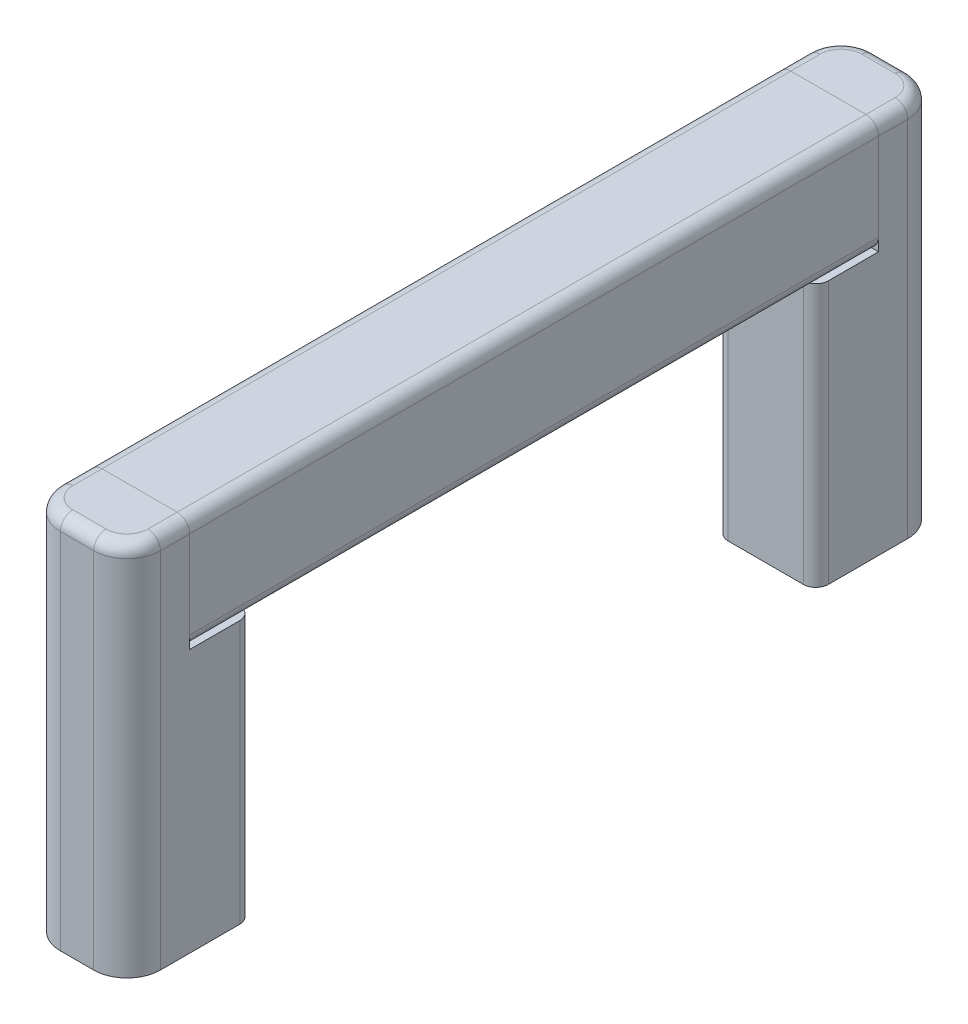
ISO-10303-21;
HEADER;
FILE_DESCRIPTION(('STEP AP214'),'2;1');
FILE_NAME('part.step','',(''),(''),'','','');
FILE_SCHEMA(('AUTOMOTIVE_DESIGN { 1 0 10303 214 1 1 1 1 }'));
ENDSEC;
DATA;
#1=APPLICATION_CONTEXT('core data for automotive mechanical design processes');
#2=APPLICATION_PROTOCOL_DEFINITION('international standard','automotive_design',2000,#1);
#3=PRODUCT_CONTEXT('',#1,'mechanical');
#4=PRODUCT('Part','Part','',(#3));
#5=PRODUCT_RELATED_PRODUCT_CATEGORY('part','',(#4));
#6=PRODUCT_DEFINITION_FORMATION('','',#4);
#7=PRODUCT_DEFINITION_CONTEXT('part definition',#1,'design');
#8=PRODUCT_DEFINITION('design','',#6,#7);
#9=PRODUCT_DEFINITION_SHAPE('','',#8);
#10=(LENGTH_UNIT() NAMED_UNIT(*) SI_UNIT(.MILLI.,.METRE.));
#11=(NAMED_UNIT(*) PLANE_ANGLE_UNIT() SI_UNIT($,.RADIAN.));
#12=(NAMED_UNIT(*) SI_UNIT($,.STERADIAN.) SOLID_ANGLE_UNIT());
#13=UNCERTAINTY_MEASURE_WITH_UNIT(LENGTH_MEASURE(1.E-05),#10,'distance_accuracy_value','');
#14=(GEOMETRIC_REPRESENTATION_CONTEXT(3) GLOBAL_UNCERTAINTY_ASSIGNED_CONTEXT((#13)) GLOBAL_UNIT_ASSIGNED_CONTEXT((#10,
#11,#12)) REPRESENTATION_CONTEXT('',''));
#15=CARTESIAN_POINT('',(0.,0.,0.));
#16=DIRECTION('',(0.,0.,1.));
#17=DIRECTION('',(1.,0.,0.));
#18=AXIS2_PLACEMENT_3D('',#15,#16,#17);
#19=CARTESIAN_POINT('',(-3.,3.50000000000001,27.5));
#20=DIRECTION('',(0.,0.,1.));
#21=DIRECTION('',(1.,0.,0.));
#22=AXIS2_PLACEMENT_3D('',#19,#20,#21);
#23=PLANE('',#22);
#24=CARTESIAN_POINT('',(-3.,3.50000000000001,27.5));
#25=DIRECTION('',(0.,0.,1.));
#26=DIRECTION('',(1.,0.,0.));
#27=AXIS2_PLACEMENT_3D('',#24,#25,#26);
#28=CIRCLE('',#27,1.);
#29=CARTESIAN_POINT('',(-3.,4.50000000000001,27.5));
#30=VERTEX_POINT('',#29);
#31=CARTESIAN_POINT('',(-4.,3.50000000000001,27.5));
#32=VERTEX_POINT('',#31);
#33=EDGE_CURVE('P0_E140',#30,#32,#28,.T.);
#34=ORIENTED_EDGE('',*,*,#33,.T.);
#35=DIRECTION('',(0.,-1.,0.));
#36=VECTOR('',#35,1.);
#37=CARTESIAN_POINT('',(-4.,3.50000000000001,27.5));
#38=LINE('',#37,#36);
#39=CARTESIAN_POINT('',(-4.,-3.49999999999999,27.5));
#40=VERTEX_POINT('',#39);
#41=EDGE_CURVE('P0_E129',#32,#40,#38,.T.);
#42=ORIENTED_EDGE('',*,*,#41,.T.);
#43=CARTESIAN_POINT('',(-3.,-3.49999999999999,27.5));
#44=DIRECTION('',(0.,0.,1.));
#45=DIRECTION('',(1.,0.,0.));
#46=AXIS2_PLACEMENT_3D('',#43,#44,#45);
#47=CIRCLE('',#46,1.);
#48=CARTESIAN_POINT('',(-3.,-4.49999999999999,27.5));
#49=VERTEX_POINT('',#48);
#50=EDGE_CURVE('P0_E139',#40,#49,#47,.T.);
#51=ORIENTED_EDGE('',*,*,#50,.T.);
#52=DIRECTION('',(1.,0.,0.));
#53=VECTOR('',#52,1.);
#54=CARTESIAN_POINT('',(-3.,-4.49999999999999,27.5));
#55=LINE('',#54,#53);
#56=CARTESIAN_POINT('',(3.,-4.49999999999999,27.5));
#57=VERTEX_POINT('',#56);
#58=EDGE_CURVE('P0_E224',#49,#57,#55,.T.);
#59=ORIENTED_EDGE('',*,*,#58,.T.);
#60=CARTESIAN_POINT('',(3.,-3.49999999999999,27.5));
#61=DIRECTION('',(0.,0.,1.));
#62=DIRECTION('',(1.,0.,0.));
#63=AXIS2_PLACEMENT_3D('',#60,#61,#62);
#64=CIRCLE('',#63,1.);
#65=CARTESIAN_POINT('',(4.,-3.49999999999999,27.5));
#66=VERTEX_POINT('',#65);
#67=EDGE_CURVE('P0_E226',#57,#66,#64,.T.);
#68=ORIENTED_EDGE('',*,*,#67,.T.);
#69=DIRECTION('',(0.,1.,0.));
#70=VECTOR('',#69,1.);
#71=CARTESIAN_POINT('',(4.,3.50000000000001,27.5));
#72=LINE('',#71,#70);
#73=CARTESIAN_POINT('',(4.,3.50000000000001,27.5));
#74=VERTEX_POINT('',#73);
#75=EDGE_CURVE('P0_E228',#66,#74,#72,.T.);
#76=ORIENTED_EDGE('',*,*,#75,.T.);
#77=CARTESIAN_POINT('',(3.,3.50000000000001,27.5));
#78=DIRECTION('',(0.,0.,1.));
#79=DIRECTION('',(-1.,0.,0.));
#80=AXIS2_PLACEMENT_3D('',#77,#78,#79);
#81=CIRCLE('',#80,1.);
#82=CARTESIAN_POINT('',(3.,4.50000000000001,27.5));
#83=VERTEX_POINT('',#82);
#84=EDGE_CURVE('P0_E230',#74,#83,#81,.T.);
#85=ORIENTED_EDGE('',*,*,#84,.T.);
#86=DIRECTION('',(-1.,0.,0.));
#87=VECTOR('',#86,1.);
#88=CARTESIAN_POINT('',(-3.,4.50000000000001,27.5));
#89=LINE('',#88,#87);
#90=EDGE_CURVE('P0_E144',#83,#30,#89,.T.);
#91=ORIENTED_EDGE('',*,*,#90,.T.);
#92=EDGE_LOOP('',(#34,#42,#51,#59,#68,#76,#85,#91));
#93=FACE_BOUND('',#92,.T.);
#94=DIRECTION('',(-1.,0.,0.));
#95=VECTOR('',#94,1.);
#96=CARTESIAN_POINT('',(-1.33333333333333,1.5,27.5));
#97=LINE('',#96,#95);
#98=CARTESIAN_POINT('',(0.833333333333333,1.5,27.5));
#99=VERTEX_POINT('',#98);
#100=CARTESIAN_POINT('',(-0.833333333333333,1.5,27.5));
#101=VERTEX_POINT('',#100);
#102=EDGE_CURVE('P0_E206',#99,#101,#97,.T.);
#103=ORIENTED_EDGE('',*,*,#102,.F.);
#104=CARTESIAN_POINT('',(0.833333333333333,1.,27.5));
#105=DIRECTION('',(0.,0.,1.));
#106=DIRECTION('',(1.,0.,0.));
#107=AXIS2_PLACEMENT_3D('',#104,#105,#106);
#108=CIRCLE('',#107,0.5);
#109=CARTESIAN_POINT('',(1.33333333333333,1.,27.5));
#110=VERTEX_POINT('',#109);
#111=EDGE_CURVE('P0_E187',#99,#110,#108,.F.);
#112=ORIENTED_EDGE('',*,*,#111,.T.);
#113=DIRECTION('',(0.,1.,0.));
#114=VECTOR('',#113,1.);
#115=CARTESIAN_POINT('',(1.33333333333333,-1.5,27.5));
#116=LINE('',#115,#114);
#117=CARTESIAN_POINT('',(1.33333333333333,-0.999999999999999,27.5));
#118=VERTEX_POINT('',#117);
#119=EDGE_CURVE('P0_E209',#118,#110,#116,.T.);
#120=ORIENTED_EDGE('',*,*,#119,.F.);
#121=CARTESIAN_POINT('',(0.833333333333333,-0.999999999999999,27.5));
#122=DIRECTION('',(0.,0.,1.));
#123=DIRECTION('',(1.,0.,0.));
#124=AXIS2_PLACEMENT_3D('',#121,#122,#123);
#125=CIRCLE('',#124,0.5);
#126=CARTESIAN_POINT('',(0.833333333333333,-1.5,27.5));
#127=VERTEX_POINT('',#126);
#128=EDGE_CURVE('P0_E183',#118,#127,#125,.F.);
#129=ORIENTED_EDGE('',*,*,#128,.T.);
#130=DIRECTION('',(1.,0.,0.));
#131=VECTOR('',#130,1.);
#132=CARTESIAN_POINT('',(-1.33333333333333,-1.5,27.5));
#133=LINE('',#132,#131);
#134=CARTESIAN_POINT('',(-0.833333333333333,-1.5,27.5));
#135=VERTEX_POINT('',#134);
#136=EDGE_CURVE('P0_E211',#135,#127,#133,.T.);
#137=ORIENTED_EDGE('',*,*,#136,.F.);
#138=CARTESIAN_POINT('',(-0.833333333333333,-0.999999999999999,27.5));
#139=DIRECTION('',(0.,0.,1.));
#140=DIRECTION('',(1.,0.,0.));
#141=AXIS2_PLACEMENT_3D('',#138,#139,#140);
#142=CIRCLE('',#141,0.5);
#143=CARTESIAN_POINT('',(-1.33333333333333,-0.999999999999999,27.5));
#144=VERTEX_POINT('',#143);
#145=EDGE_CURVE('P0_E179',#135,#144,#142,.F.);
#146=ORIENTED_EDGE('',*,*,#145,.T.);
#147=DIRECTION('',(0.,-1.,0.));
#148=VECTOR('',#147,1.);
#149=CARTESIAN_POINT('',(-1.33333333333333,-1.5,27.5));
#150=LINE('',#149,#148);
#151=CARTESIAN_POINT('',(-1.33333333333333,1.,27.5));
#152=VERTEX_POINT('',#151);
#153=EDGE_CURVE('P0_E208',#152,#144,#150,.T.);
#154=ORIENTED_EDGE('',*,*,#153,.F.);
#155=CARTESIAN_POINT('',(-0.833333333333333,0.999999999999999,27.5));
#156=DIRECTION('',(0.,0.,1.));
#157=DIRECTION('',(1.,0.,0.));
#158=AXIS2_PLACEMENT_3D('',#155,#156,#157);
#159=CIRCLE('',#158,0.5);
#160=EDGE_CURVE('P0_E11',#152,#101,#159,.F.);
#161=ORIENTED_EDGE('',*,*,#160,.T.);
#162=EDGE_LOOP('',(#103,#112,#120,#129,#137,#146,#154,#161));
#163=FACE_BOUND('',#162,.T.);
#164=ADVANCED_FACE('P0_F16',(#93,#163),#23,.T.);
#165=CARTESIAN_POINT('',(-3.,3.50000000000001,-27.5));
#166=DIRECTION('',(0.,0.,1.));
#167=DIRECTION('',(1.,0.,0.));
#168=AXIS2_PLACEMENT_3D('',#165,#166,#167);
#169=PLANE('',#168);
#170=CARTESIAN_POINT('',(-3.,3.50000000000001,-27.5));
#171=DIRECTION('',(0.,0.,1.));
#172=DIRECTION('',(1.,0.,0.));
#173=AXIS2_PLACEMENT_3D('',#170,#171,#172);
#174=CIRCLE('',#173,1.);
#175=CARTESIAN_POINT('',(-3.,4.50000000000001,-27.5));
#176=VERTEX_POINT('',#175);
#177=CARTESIAN_POINT('',(-4.,3.50000000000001,-27.5));
#178=VERTEX_POINT('',#177);
#179=EDGE_CURVE('P0_E152',#176,#178,#174,.T.);
#180=ORIENTED_EDGE('',*,*,#179,.F.);
#181=DIRECTION('',(-1.,0.,0.));
#182=VECTOR('',#181,1.);
#183=CARTESIAN_POINT('',(-3.,4.50000000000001,-27.5));
#184=LINE('',#183,#182);
#185=CARTESIAN_POINT('',(3.,4.50000000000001,-27.5));
#186=VERTEX_POINT('',#185);
#187=EDGE_CURVE('P0_E148',#186,#176,#184,.T.);
#188=ORIENTED_EDGE('',*,*,#187,.F.);
#189=CARTESIAN_POINT('',(3.,3.50000000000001,-27.5));
#190=DIRECTION('',(0.,0.,1.));
#191=DIRECTION('',(-1.,0.,0.));
#192=AXIS2_PLACEMENT_3D('',#189,#190,#191);
#193=CIRCLE('',#192,1.);
#194=CARTESIAN_POINT('',(4.,3.50000000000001,-27.5));
#195=VERTEX_POINT('',#194);
#196=EDGE_CURVE('P0_E245',#195,#186,#193,.T.);
#197=ORIENTED_EDGE('',*,*,#196,.F.);
#198=DIRECTION('',(0.,1.,0.));
#199=VECTOR('',#198,1.);
#200=CARTESIAN_POINT('',(4.,3.50000000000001,-27.5));
#201=LINE('',#200,#199);
#202=CARTESIAN_POINT('',(4.,-3.49999999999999,-27.5));
#203=VERTEX_POINT('',#202);
#204=EDGE_CURVE('P0_E243',#203,#195,#201,.T.);
#205=ORIENTED_EDGE('',*,*,#204,.F.);
#206=CARTESIAN_POINT('',(3.,-3.49999999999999,-27.5));
#207=DIRECTION('',(0.,0.,1.));
#208=DIRECTION('',(1.,0.,0.));
#209=AXIS2_PLACEMENT_3D('',#206,#207,#208);
#210=CIRCLE('',#209,1.);
#211=CARTESIAN_POINT('',(3.,-4.49999999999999,-27.5));
#212=VERTEX_POINT('',#211);
#213=EDGE_CURVE('P0_E241',#212,#203,#210,.T.);
#214=ORIENTED_EDGE('',*,*,#213,.F.);
#215=DIRECTION('',(1.,0.,0.));
#216=VECTOR('',#215,1.);
#217=CARTESIAN_POINT('',(-3.,-4.49999999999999,-27.5));
#218=LINE('',#217,#216);
#219=CARTESIAN_POINT('',(-3.,-4.49999999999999,-27.5));
#220=VERTEX_POINT('',#219);
#221=EDGE_CURVE('P0_E239',#220,#212,#218,.T.);
#222=ORIENTED_EDGE('',*,*,#221,.F.);
#223=CARTESIAN_POINT('',(-3.,-3.49999999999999,-27.5));
#224=DIRECTION('',(0.,0.,1.));
#225=DIRECTION('',(1.,0.,0.));
#226=AXIS2_PLACEMENT_3D('',#223,#224,#225);
#227=CIRCLE('',#226,1.);
#228=CARTESIAN_POINT('',(-4.,-3.49999999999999,-27.5));
#229=VERTEX_POINT('',#228);
#230=EDGE_CURVE('P0_E237',#229,#220,#227,.T.);
#231=ORIENTED_EDGE('',*,*,#230,.F.);
#232=DIRECTION('',(0.,-1.,0.));
#233=VECTOR('',#232,1.);
#234=CARTESIAN_POINT('',(-4.,3.50000000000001,-27.5));
#235=LINE('',#234,#233);
#236=EDGE_CURVE('P0_E235',#178,#229,#235,.T.);
#237=ORIENTED_EDGE('',*,*,#236,.F.);
#238=EDGE_LOOP('',(#180,#188,#197,#205,#214,#222,#231,#237));
#239=FACE_BOUND('',#238,.T.);
#240=DIRECTION('',(1.,0.,0.));
#241=VECTOR('',#240,1.);
#242=CARTESIAN_POINT('',(-1.33333333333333,-1.5,-27.5));
#243=LINE('',#242,#241);
#244=CARTESIAN_POINT('',(-0.833333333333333,-1.5,-27.5));
#245=VERTEX_POINT('',#244);
#246=CARTESIAN_POINT('',(0.833333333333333,-1.5,-27.5));
#247=VERTEX_POINT('',#246);
#248=EDGE_CURVE('P0_E203',#245,#247,#243,.T.);
#249=ORIENTED_EDGE('',*,*,#248,.T.);
#250=CARTESIAN_POINT('',(0.833333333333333,-0.999999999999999,-27.5));
#251=DIRECTION('',(0.,0.,1.));
#252=DIRECTION('',(1.,0.,0.));
#253=AXIS2_PLACEMENT_3D('',#250,#251,#252);
#254=CIRCLE('',#253,0.5);
#255=CARTESIAN_POINT('',(1.33333333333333,-0.999999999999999,-27.5));
#256=VERTEX_POINT('',#255);
#257=EDGE_CURVE('P0_E181',#247,#256,#254,.T.);
#258=ORIENTED_EDGE('',*,*,#257,.T.);
#259=DIRECTION('',(0.,1.,0.));
#260=VECTOR('',#259,1.);
#261=CARTESIAN_POINT('',(1.33333333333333,-1.5,-27.5));
#262=LINE('',#261,#260);
#263=CARTESIAN_POINT('',(1.33333333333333,1.,-27.5));
#264=VERTEX_POINT('',#263);
#265=EDGE_CURVE('P0_E218',#256,#264,#262,.T.);
#266=ORIENTED_EDGE('',*,*,#265,.T.);
#267=CARTESIAN_POINT('',(0.833333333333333,1.,-27.5));
#268=DIRECTION('',(0.,0.,1.));
#269=DIRECTION('',(1.,0.,0.));
#270=AXIS2_PLACEMENT_3D('',#267,#268,#269);
#271=CIRCLE('',#270,0.5);
#272=CARTESIAN_POINT('',(0.833333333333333,1.5,-27.5));
#273=VERTEX_POINT('',#272);
#274=EDGE_CURVE('P0_E185',#264,#273,#271,.T.);
#275=ORIENTED_EDGE('',*,*,#274,.T.);
#276=DIRECTION('',(-1.,0.,0.));
#277=VECTOR('',#276,1.);
#278=CARTESIAN_POINT('',(-1.33333333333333,1.5,-27.5));
#279=LINE('',#278,#277);
#280=CARTESIAN_POINT('',(-0.833333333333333,1.5,-27.5));
#281=VERTEX_POINT('',#280);
#282=EDGE_CURVE('P0_E195',#273,#281,#279,.T.);
#283=ORIENTED_EDGE('',*,*,#282,.T.);
#284=CARTESIAN_POINT('',(-0.833333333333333,0.999999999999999,-27.5));
#285=DIRECTION('',(0.,0.,1.));
#286=DIRECTION('',(1.,0.,0.));
#287=AXIS2_PLACEMENT_3D('',#284,#285,#286);
#288=CIRCLE('',#287,0.5);
#289=CARTESIAN_POINT('',(-1.33333333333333,1.,-27.5));
#290=VERTEX_POINT('',#289);
#291=EDGE_CURVE('P0_E24',#281,#290,#288,.T.);
#292=ORIENTED_EDGE('',*,*,#291,.T.);
#293=DIRECTION('',(0.,-1.,0.));
#294=VECTOR('',#293,1.);
#295=CARTESIAN_POINT('',(-1.33333333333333,-1.5,-27.5));
#296=LINE('',#295,#294);
#297=CARTESIAN_POINT('',(-1.33333333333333,-0.999999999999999,-27.5));
#298=VERTEX_POINT('',#297);
#299=EDGE_CURVE('P0_E194',#290,#298,#296,.T.);
#300=ORIENTED_EDGE('',*,*,#299,.T.);
#301=CARTESIAN_POINT('',(-0.833333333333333,-0.999999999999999,-27.5));
#302=DIRECTION('',(0.,0.,1.));
#303=DIRECTION('',(1.,0.,0.));
#304=AXIS2_PLACEMENT_3D('',#301,#302,#303);
#305=CIRCLE('',#304,0.5);
#306=EDGE_CURVE('P0_E177',#298,#245,#305,.T.);
#307=ORIENTED_EDGE('',*,*,#306,.T.);
#308=EDGE_LOOP('',(#249,#258,#266,#275,#283,#292,#300,#307));
#309=FACE_BOUND('',#308,.T.);
#310=ADVANCED_FACE('P0_F193',(#239,#309),#169,.F.);
#311=CARTESIAN_POINT('',(-3.,3.50000000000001,27.5));
#312=DIRECTION('',(0.,0.,-1.));
#313=DIRECTION('',(-1.,0.,0.));
#314=AXIS2_PLACEMENT_3D('',#311,#312,#313);
#315=CYLINDRICAL_SURFACE('',#314,1.);
#316=ORIENTED_EDGE('',*,*,#179,.T.);
#317=DIRECTION('',(0.,0.,-1.));
#318=VECTOR('',#317,1.);
#319=CARTESIAN_POINT('',(-4.,3.50000000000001,27.5));
#320=LINE('',#319,#318);
#321=EDGE_CURVE('P0_E133',#32,#178,#320,.T.);
#322=ORIENTED_EDGE('',*,*,#321,.F.);
#323=ORIENTED_EDGE('',*,*,#33,.F.);
#324=DIRECTION('',(0.,0.,-1.));
#325=VECTOR('',#324,1.);
#326=CARTESIAN_POINT('',(-3.,4.50000000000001,27.5));
#327=LINE('',#326,#325);
#328=EDGE_CURVE('P0_E233',#30,#176,#327,.T.);
#329=ORIENTED_EDGE('',*,*,#328,.T.);
#330=EDGE_LOOP('',(#316,#322,#323,#329));
#331=FACE_BOUND('',#330,.T.);
#332=ADVANCED_FACE('P0_F150',(#331),#315,.T.);
#333=CARTESIAN_POINT('',(-4.,3.50000000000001,27.5));
#334=DIRECTION('',(1.,0.,0.));
#335=DIRECTION('',(0.,0.,-1.));
#336=AXIS2_PLACEMENT_3D('',#333,#334,#335);
#337=PLANE('',#336);
#338=ORIENTED_EDGE('',*,*,#236,.T.);
#339=DIRECTION('',(0.,0.,-1.));
#340=VECTOR('',#339,1.);
#341=CARTESIAN_POINT('',(-4.,-3.49999999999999,27.5));
#342=LINE('',#341,#340);
#343=EDGE_CURVE('P0_E136',#40,#229,#342,.T.);
#344=ORIENTED_EDGE('',*,*,#343,.F.);
#345=ORIENTED_EDGE('',*,*,#41,.F.);
#346=ORIENTED_EDGE('',*,*,#321,.T.);
#347=EDGE_LOOP('',(#338,#344,#345,#346));
#348=FACE_BOUND('',#347,.T.);
#349=ADVANCED_FACE('P0_F131',(#348),#337,.F.);
#350=CARTESIAN_POINT('',(-3.,-3.49999999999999,27.5));
#351=DIRECTION('',(0.,0.,-1.));
#352=DIRECTION('',(-1.,0.,0.));
#353=AXIS2_PLACEMENT_3D('',#350,#351,#352);
#354=CYLINDRICAL_SURFACE('',#353,1.);
#355=ORIENTED_EDGE('',*,*,#230,.T.);
#356=DIRECTION('',(0.,0.,-1.));
#357=VECTOR('',#356,1.);
#358=CARTESIAN_POINT('',(-3.,-4.49999999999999,27.5));
#359=LINE('',#358,#357);
#360=EDGE_CURVE('P0_E157',#49,#220,#359,.T.);
#361=ORIENTED_EDGE('',*,*,#360,.F.);
#362=ORIENTED_EDGE('',*,*,#50,.F.);
#363=ORIENTED_EDGE('',*,*,#343,.T.);
#364=EDGE_LOOP('',(#355,#361,#362,#363));
#365=FACE_BOUND('',#364,.T.);
#366=ADVANCED_FACE('P0_F283',(#365),#354,.T.);
#367=CARTESIAN_POINT('',(-3.,-4.49999999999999,27.5));
#368=DIRECTION('',(0.,1.,0.));
#369=DIRECTION('',(0.,0.,1.));
#370=AXIS2_PLACEMENT_3D('',#367,#368,#369);
#371=PLANE('',#370);
#372=ORIENTED_EDGE('',*,*,#221,.T.);
#373=DIRECTION('',(0.,0.,-1.));
#374=VECTOR('',#373,1.);
#375=CARTESIAN_POINT('',(3.,-4.49999999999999,27.5));
#376=LINE('',#375,#374);
#377=EDGE_CURVE('P0_E258',#57,#212,#376,.T.);
#378=ORIENTED_EDGE('',*,*,#377,.F.);
#379=ORIENTED_EDGE('',*,*,#58,.F.);
#380=ORIENTED_EDGE('',*,*,#360,.T.);
#381=EDGE_LOOP('',(#372,#378,#379,#380));
#382=FACE_BOUND('',#381,.T.);
#383=ADVANCED_FACE('P0_F265',(#382),#371,.F.);
#384=CARTESIAN_POINT('',(3.,-3.49999999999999,27.5));
#385=DIRECTION('',(0.,0.,-1.));
#386=DIRECTION('',(-1.,0.,0.));
#387=AXIS2_PLACEMENT_3D('',#384,#385,#386);
#388=CYLINDRICAL_SURFACE('',#387,1.);
#389=ORIENTED_EDGE('',*,*,#213,.T.);
#390=DIRECTION('',(0.,0.,-1.));
#391=VECTOR('',#390,1.);
#392=CARTESIAN_POINT('',(4.,-3.49999999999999,27.5));
#393=LINE('',#392,#391);
#394=EDGE_CURVE('P0_E255',#66,#203,#393,.T.);
#395=ORIENTED_EDGE('',*,*,#394,.F.);
#396=ORIENTED_EDGE('',*,*,#67,.F.);
#397=ORIENTED_EDGE('',*,*,#377,.T.);
#398=EDGE_LOOP('',(#389,#395,#396,#397));
#399=FACE_BOUND('',#398,.T.);
#400=ADVANCED_FACE('P0_F275',(#399),#388,.T.);
#401=CARTESIAN_POINT('',(4.,3.50000000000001,27.5));
#402=DIRECTION('',(-1.,0.,0.));
#403=DIRECTION('',(0.,0.,1.));
#404=AXIS2_PLACEMENT_3D('',#401,#402,#403);
#405=PLANE('',#404);
#406=ORIENTED_EDGE('',*,*,#204,.T.);
#407=DIRECTION('',(0.,0.,-1.));
#408=VECTOR('',#407,1.);
#409=CARTESIAN_POINT('',(4.,3.50000000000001,27.5));
#410=LINE('',#409,#408);
#411=EDGE_CURVE('P0_E252',#74,#195,#410,.T.);
#412=ORIENTED_EDGE('',*,*,#411,.F.);
#413=ORIENTED_EDGE('',*,*,#75,.F.);
#414=ORIENTED_EDGE('',*,*,#394,.T.);
#415=EDGE_LOOP('',(#406,#412,#413,#414));
#416=FACE_BOUND('',#415,.T.);
#417=ADVANCED_FACE('P0_F279',(#416),#405,.F.);
#418=CARTESIAN_POINT('',(3.,3.50000000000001,27.5));
#419=DIRECTION('',(0.,0.,-1.));
#420=DIRECTION('',(-1.,0.,0.));
#421=AXIS2_PLACEMENT_3D('',#418,#419,#420);
#422=CYLINDRICAL_SURFACE('',#421,1.);
#423=ORIENTED_EDGE('',*,*,#196,.T.);
#424=DIRECTION('',(0.,0.,-1.));
#425=VECTOR('',#424,1.);
#426=CARTESIAN_POINT('',(3.,4.50000000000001,27.5));
#427=LINE('',#426,#425);
#428=EDGE_CURVE('P0_E249',#83,#186,#427,.T.);
#429=ORIENTED_EDGE('',*,*,#428,.F.);
#430=ORIENTED_EDGE('',*,*,#84,.F.);
#431=ORIENTED_EDGE('',*,*,#411,.T.);
#432=EDGE_LOOP('',(#423,#429,#430,#431));
#433=FACE_BOUND('',#432,.T.);
#434=ADVANCED_FACE('P0_F306',(#433),#422,.T.);
#435=CARTESIAN_POINT('',(-3.,4.50000000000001,27.5));
#436=DIRECTION('',(0.,-1.,0.));
#437=DIRECTION('',(0.,0.,-1.));
#438=AXIS2_PLACEMENT_3D('',#435,#436,#437);
#439=PLANE('',#438);
#440=ORIENTED_EDGE('',*,*,#187,.T.);
#441=ORIENTED_EDGE('',*,*,#328,.F.);
#442=ORIENTED_EDGE('',*,*,#90,.F.);
#443=ORIENTED_EDGE('',*,*,#428,.T.);
#444=EDGE_LOOP('',(#440,#441,#442,#443));
#445=FACE_BOUND('',#444,.T.);
#446=ADVANCED_FACE('P0_F303',(#445),#439,.F.);
#447=CARTESIAN_POINT('',(1.33333333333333,-1.5,27.5));
#448=DIRECTION('',(-1.,0.,0.));
#449=DIRECTION('',(0.,0.,1.));
#450=AXIS2_PLACEMENT_3D('',#447,#448,#449);
#451=PLANE('',#450);
#452=ORIENTED_EDGE('',*,*,#265,.F.);
#453=DIRECTION('',(0.,0.,-1.));
#454=VECTOR('',#453,1.);
#455=CARTESIAN_POINT('',(1.33333333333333,-0.999999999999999,27.5));
#456=LINE('',#455,#454);
#457=EDGE_CURVE('P0_E171',#256,#118,#456,.F.);
#458=ORIENTED_EDGE('',*,*,#457,.T.);
#459=ORIENTED_EDGE('',*,*,#119,.T.);
#460=DIRECTION('',(0.,0.,-1.));
#461=VECTOR('',#460,1.);
#462=CARTESIAN_POINT('',(1.33333333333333,1.,-27.5));
#463=LINE('',#462,#461);
#464=EDGE_CURVE('P0_E168',#110,#264,#463,.T.);
#465=ORIENTED_EDGE('',*,*,#464,.T.);
#466=EDGE_LOOP('',(#452,#458,#459,#465));
#467=FACE_BOUND('',#466,.T.);
#468=ADVANCED_FACE('P0_F300',(#467),#451,.T.);
#469=CARTESIAN_POINT('',(-1.33333333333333,1.5,27.5));
#470=DIRECTION('',(0.,-1.,0.));
#471=DIRECTION('',(1.,0.,0.));
#472=AXIS2_PLACEMENT_3D('',#469,#470,#471);
#473=PLANE('',#472);
#474=ORIENTED_EDGE('',*,*,#282,.F.);
#475=DIRECTION('',(0.,0.,-1.));
#476=VECTOR('',#475,1.);
#477=CARTESIAN_POINT('',(0.833333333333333,1.5,27.5));
#478=LINE('',#477,#476);
#479=EDGE_CURVE('P0_E36',#273,#99,#478,.F.);
#480=ORIENTED_EDGE('',*,*,#479,.T.);
#481=ORIENTED_EDGE('',*,*,#102,.T.);
#482=DIRECTION('',(0.,0.,-1.));
#483=VECTOR('',#482,1.);
#484=CARTESIAN_POINT('',(-0.833333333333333,1.5,-27.5));
#485=LINE('',#484,#483);
#486=EDGE_CURVE('P0_E173',#101,#281,#485,.T.);
#487=ORIENTED_EDGE('',*,*,#486,.T.);
#488=EDGE_LOOP('',(#474,#480,#481,#487));
#489=FACE_BOUND('',#488,.T.);
#490=ADVANCED_FACE('P0_F205',(#489),#473,.T.);
#491=CARTESIAN_POINT('',(-1.33333333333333,-1.5,27.5));
#492=DIRECTION('',(1.,0.,0.));
#493=DIRECTION('',(0.,0.,-1.));
#494=AXIS2_PLACEMENT_3D('',#491,#492,#493);
#495=PLANE('',#494);
#496=ORIENTED_EDGE('',*,*,#153,.T.);
#497=DIRECTION('',(0.,0.,-1.));
#498=VECTOR('',#497,1.);
#499=CARTESIAN_POINT('',(-1.33333333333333,-0.999999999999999,-27.5));
#500=LINE('',#499,#498);
#501=EDGE_CURVE('P0_E155',#144,#298,#500,.T.);
#502=ORIENTED_EDGE('',*,*,#501,.T.);
#503=ORIENTED_EDGE('',*,*,#299,.F.);
#504=DIRECTION('',(0.,0.,-1.));
#505=VECTOR('',#504,1.);
#506=CARTESIAN_POINT('',(-1.33333333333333,0.999999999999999,27.5));
#507=LINE('',#506,#505);
#508=EDGE_CURVE('P0_E153',#290,#152,#507,.F.);
#509=ORIENTED_EDGE('',*,*,#508,.T.);
#510=EDGE_LOOP('',(#496,#502,#503,#509));
#511=FACE_BOUND('',#510,.T.);
#512=ADVANCED_FACE('P0_F201',(#511),#495,.T.);
#513=CARTESIAN_POINT('',(-1.33333333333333,-1.5,27.5));
#514=DIRECTION('',(0.,1.,0.));
#515=DIRECTION('',(0.,0.,1.));
#516=AXIS2_PLACEMENT_3D('',#513,#514,#515);
#517=PLANE('',#516);
#518=ORIENTED_EDGE('',*,*,#248,.F.);
#519=DIRECTION('',(0.,0.,-1.));
#520=VECTOR('',#519,1.);
#521=CARTESIAN_POINT('',(-0.833333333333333,-1.5,27.5));
#522=LINE('',#521,#520);
#523=EDGE_CURVE('P0_E166',#245,#135,#522,.F.);
#524=ORIENTED_EDGE('',*,*,#523,.T.);
#525=ORIENTED_EDGE('',*,*,#136,.T.);
#526=DIRECTION('',(0.,0.,-1.));
#527=VECTOR('',#526,1.);
#528=CARTESIAN_POINT('',(0.833333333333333,-1.5,-27.5));
#529=LINE('',#528,#527);
#530=EDGE_CURVE('P0_E163',#127,#247,#529,.T.);
#531=ORIENTED_EDGE('',*,*,#530,.T.);
#532=EDGE_LOOP('',(#518,#524,#525,#531));
#533=FACE_BOUND('',#532,.T.);
#534=ADVANCED_FACE('P0_F355',(#533),#517,.T.);
#535=CARTESIAN_POINT('',(-0.833333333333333,-0.999999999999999,27.5));
#536=DIRECTION('',(0.,0.,1.));
#537=DIRECTION('',(1.,0.,0.));
#538=AXIS2_PLACEMENT_3D('',#535,#536,#537);
#539=CYLINDRICAL_SURFACE('',#538,0.5);
#540=ORIENTED_EDGE('',*,*,#145,.F.);
#541=ORIENTED_EDGE('',*,*,#523,.F.);
#542=ORIENTED_EDGE('',*,*,#306,.F.);
#543=ORIENTED_EDGE('',*,*,#501,.F.);
#544=EDGE_LOOP('',(#540,#541,#542,#543));
#545=FACE_BOUND('',#544,.T.);
#546=ADVANCED_FACE('P0_F363',(#545),#539,.F.);
#547=CARTESIAN_POINT('',(0.833333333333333,-0.999999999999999,27.5));
#548=DIRECTION('',(0.,0.,1.));
#549=DIRECTION('',(1.,0.,0.));
#550=AXIS2_PLACEMENT_3D('',#547,#548,#549);
#551=CYLINDRICAL_SURFACE('',#550,0.5);
#552=ORIENTED_EDGE('',*,*,#128,.F.);
#553=ORIENTED_EDGE('',*,*,#457,.F.);
#554=ORIENTED_EDGE('',*,*,#257,.F.);
#555=ORIENTED_EDGE('',*,*,#530,.F.);
#556=EDGE_LOOP('',(#552,#553,#554,#555));
#557=FACE_BOUND('',#556,.T.);
#558=ADVANCED_FACE('P0_F372',(#557),#551,.F.);
#559=CARTESIAN_POINT('',(0.833333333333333,1.,27.5));
#560=DIRECTION('',(0.,0.,1.));
#561=DIRECTION('',(1.,0.,0.));
#562=AXIS2_PLACEMENT_3D('',#559,#560,#561);
#563=CYLINDRICAL_SURFACE('',#562,0.5);
#564=ORIENTED_EDGE('',*,*,#111,.F.);
#565=ORIENTED_EDGE('',*,*,#479,.F.);
#566=ORIENTED_EDGE('',*,*,#274,.F.);
#567=ORIENTED_EDGE('',*,*,#464,.F.);
#568=EDGE_LOOP('',(#564,#565,#566,#567));
#569=FACE_BOUND('',#568,.T.);
#570=ADVANCED_FACE('P0_F381',(#569),#563,.F.);
#571=CARTESIAN_POINT('',(-0.833333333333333,0.999999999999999,27.5));
#572=DIRECTION('',(0.,0.,1.));
#573=DIRECTION('',(1.,0.,0.));
#574=AXIS2_PLACEMENT_3D('',#571,#572,#573);
#575=CYLINDRICAL_SURFACE('',#574,0.5);
#576=ORIENTED_EDGE('',*,*,#160,.F.);
#577=ORIENTED_EDGE('',*,*,#508,.F.);
#578=ORIENTED_EDGE('',*,*,#291,.F.);
#579=ORIENTED_EDGE('',*,*,#486,.F.);
#580=EDGE_LOOP('',(#576,#577,#578,#579));
#581=FACE_BOUND('',#580,.T.);
#582=ADVANCED_FACE('P0_F18',(#581),#575,.F.);
#583=CLOSED_SHELL('',(#164,#310,#332,#349,#366,#383,#400,#417,#434,#446,#468,#490,#512,#534,
#546,#558,#570,#582));
#584=MANIFOLD_SOLID_BREP('P0_B1',#583);
#585=CARTESIAN_POINT('',(0.,-25.5,-27.5));
#586=DIRECTION('',(0.,1.,0.));
#587=DIRECTION('',(-1.,0.,0.));
#588=AXIS2_PLACEMENT_3D('',#585,#586,#587);
#589=CYLINDRICAL_SURFACE('',#588,3.24999999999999);
#590=CARTESIAN_POINT('',(0.,-11.2769088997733,-27.5));
#591=DIRECTION('',(0.,1.,0.));
#592=DIRECTION('',(-1.,0.,0.));
#593=AXIS2_PLACEMENT_3D('',#590,#591,#592);
#594=CIRCLE('',#593,3.24999999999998);
#595=CARTESIAN_POINT('',(-3.24999999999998,-11.2769088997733,-27.5));
#596=VERTEX_POINT('',#595);
#597=EDGE_CURVE('P1_E11',#596,#596,#594,.T.);
#598=ORIENTED_EDGE('',*,*,#597,.F.);
#599=EDGE_LOOP('',(#598));
#600=FACE_BOUND('',#599,.T.);
#601=CARTESIAN_POINT('',(0.,-25.5,-27.5));
#602=DIRECTION('',(0.,1.,0.));
#603=DIRECTION('',(-1.,0.,0.));
#604=AXIS2_PLACEMENT_3D('',#601,#602,#603);
#605=CIRCLE('',#604,3.25);
#606=CARTESIAN_POINT('',(-3.25,-25.5,-27.5));
#607=VERTEX_POINT('',#606);
#608=EDGE_CURVE('P1_E51',#607,#607,#605,.T.);
#609=ORIENTED_EDGE('',*,*,#608,.T.);
#610=EDGE_LOOP('',(#609));
#611=FACE_BOUND('',#610,.T.);
#612=ADVANCED_FACE('P1_F16',(#600,#611),#589,.T.);
#613=CARTESIAN_POINT('',(0.,-11.2769088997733,-27.5));
#614=DIRECTION('',(0.,1.,0.));
#615=DIRECTION('',(-1.,0.,0.));
#616=AXIS2_PLACEMENT_3D('',#613,#614,#615);
#617=TOROIDAL_SURFACE('',#616,2.25,0.999999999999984);
#618=CARTESIAN_POINT('',(0.,-10.2807142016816,-27.5));
#619=DIRECTION('',(0.,1.,0.));
#620=DIRECTION('',(-1.,0.,0.));
#621=AXIS2_PLACEMENT_3D('',#618,#619,#620);
#622=CIRCLE('',#621,2.33715574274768);
#623=CARTESIAN_POINT('',(-2.33715574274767,-10.2807142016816,-27.5));
#624=VERTEX_POINT('',#623);
#625=EDGE_CURVE('P1_E23',#624,#624,#622,.T.);
#626=ORIENTED_EDGE('',*,*,#625,.F.);
#627=EDGE_LOOP('',(#626));
#628=FACE_BOUND('',#627,.T.);
#629=ORIENTED_EDGE('',*,*,#597,.T.);
#630=EDGE_LOOP('',(#629));
#631=FACE_BOUND('',#630,.T.);
#632=ADVANCED_FACE('P1_F33',(#628,#631),#617,.T.);
#633=CARTESIAN_POINT('',(0.,-10.2807142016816,-27.5));
#634=DIRECTION('',(0.,-1.,0.));
#635=DIRECTION('',(1.,0.,0.));
#636=AXIS2_PLACEMENT_3D('',#633,#634,#635);
#637=CONICAL_SURFACE('',#636,2.33715574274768,1.48352986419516);
#638=CARTESIAN_POINT('',(0.,-10.0762395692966,-27.5));
#639=VERTEX_POINT('',#638);
#640=VERTEX_LOOP('',#639);
#641=FACE_BOUND('',#640,.T.);
#642=ORIENTED_EDGE('',*,*,#625,.T.);
#643=EDGE_LOOP('',(#642));
#644=FACE_BOUND('',#643,.T.);
#645=ADVANCED_FACE('P1_F29',(#641,#644),#637,.T.);
#646=CARTESIAN_POINT('',(0.,-13.5762395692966,-27.5));
#647=DIRECTION('',(0.,-1.,0.));
#648=DIRECTION('',(1.,0.,0.));
#649=AXIS2_PLACEMENT_3D('',#646,#647,#648);
#650=CONICAL_SURFACE('',#649,0.,1.04719755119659);
#651=CARTESIAN_POINT('',(0.,-14.5,-27.5));
#652=DIRECTION('',(0.,1.,0.));
#653=DIRECTION('',(-1.,0.,0.));
#654=AXIS2_PLACEMENT_3D('',#651,#652,#653);
#655=CIRCLE('',#654,1.6);
#656=CARTESIAN_POINT('',(-1.6,-14.5,-27.5));
#657=VERTEX_POINT('',#656);
#658=EDGE_CURVE('P1_E38',#657,#657,#655,.T.);
#659=ORIENTED_EDGE('',*,*,#658,.F.);
#660=EDGE_LOOP('',(#659));
#661=FACE_BOUND('',#660,.T.);
#662=CARTESIAN_POINT('',(0.,-13.5762395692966,-27.5));
#663=VERTEX_POINT('',#662);
#664=VERTEX_LOOP('',#663);
#665=FACE_BOUND('',#664,.T.);
#666=ADVANCED_FACE('P1_F32',(#661,#665),#650,.F.);
#667=CARTESIAN_POINT('',(0.,-25.5,-27.5));
#668=DIRECTION('',(0.,1.,0.));
#669=DIRECTION('',(-1.,0.,0.));
#670=AXIS2_PLACEMENT_3D('',#667,#668,#669);
#671=CYLINDRICAL_SURFACE('',#670,1.6);
#672=CARTESIAN_POINT('',(0.,-17.5,-27.5));
#673=DIRECTION('',(0.,1.,0.));
#674=DIRECTION('',(-1.,0.,0.));
#675=AXIS2_PLACEMENT_3D('',#672,#673,#674);
#676=CIRCLE('',#675,1.6);
#677=CARTESIAN_POINT('',(-1.6,-17.5,-27.5));
#678=VERTEX_POINT('',#677);
#679=EDGE_CURVE('P1_E40',#678,#678,#676,.T.);
#680=ORIENTED_EDGE('',*,*,#679,.F.);
#681=EDGE_LOOP('',(#680));
#682=FACE_BOUND('',#681,.T.);
#683=ORIENTED_EDGE('',*,*,#658,.T.);
#684=EDGE_LOOP('',(#683));
#685=FACE_BOUND('',#684,.T.);
#686=ADVANCED_FACE('P1_F71',(#682,#685),#671,.F.);
#687=CARTESIAN_POINT('',(0.,-17.5,-25.5));
#688=DIRECTION('',(0.,1.,0.));
#689=DIRECTION('',(-1.,0.,0.));
#690=AXIS2_PLACEMENT_3D('',#687,#688,#689);
#691=PLANE('',#690);
#692=CARTESIAN_POINT('',(0.,-17.5,-27.5));
#693=DIRECTION('',(0.,1.,0.));
#694=DIRECTION('',(-1.,0.,0.));
#695=AXIS2_PLACEMENT_3D('',#692,#693,#694);
#696=CIRCLE('',#695,2.);
#697=CARTESIAN_POINT('',(-2.,-17.5,-27.5));
#698=VERTEX_POINT('',#697);
#699=EDGE_CURVE('P1_E45',#698,#698,#696,.T.);
#700=ORIENTED_EDGE('',*,*,#699,.F.);
#701=EDGE_LOOP('',(#700));
#702=FACE_BOUND('',#701,.T.);
#703=ORIENTED_EDGE('',*,*,#679,.T.);
#704=EDGE_LOOP('',(#703));
#705=FACE_BOUND('',#704,.T.);
#706=ADVANCED_FACE('P1_F65',(#702,#705),#691,.F.);
#707=CARTESIAN_POINT('',(0.,-25.5,-27.5));
#708=DIRECTION('',(0.,1.,0.));
#709=DIRECTION('',(-1.,0.,0.));
#710=AXIS2_PLACEMENT_3D('',#707,#708,#709);
#711=CYLINDRICAL_SURFACE('',#710,2.);
#712=CARTESIAN_POINT('',(0.,-25.5,-27.5));
#713=DIRECTION('',(0.,1.,0.));
#714=DIRECTION('',(-1.,0.,0.));
#715=AXIS2_PLACEMENT_3D('',#712,#713,#714);
#716=CIRCLE('',#715,2.);
#717=CARTESIAN_POINT('',(-2.,-25.5,-27.5));
#718=VERTEX_POINT('',#717);
#719=EDGE_CURVE('P1_E48',#718,#718,#716,.T.);
#720=ORIENTED_EDGE('',*,*,#719,.F.);
#721=EDGE_LOOP('',(#720));
#722=FACE_BOUND('',#721,.T.);
#723=ORIENTED_EDGE('',*,*,#699,.T.);
#724=EDGE_LOOP('',(#723));
#725=FACE_BOUND('',#724,.T.);
#726=ADVANCED_FACE('P1_F59',(#722,#725),#711,.F.);
#727=CARTESIAN_POINT('',(0.,-25.5,-25.5));
#728=DIRECTION('',(0.,1.,0.));
#729=DIRECTION('',(-1.,0.,0.));
#730=AXIS2_PLACEMENT_3D('',#727,#728,#729);
#731=PLANE('',#730);
#732=ORIENTED_EDGE('',*,*,#608,.F.);
#733=EDGE_LOOP('',(#732));
#734=FACE_BOUND('',#733,.T.);
#735=ORIENTED_EDGE('',*,*,#719,.T.);
#736=EDGE_LOOP('',(#735));
#737=FACE_BOUND('',#736,.T.);
#738=ADVANCED_FACE('P1_F56',(#734,#737),#731,.F.);
#739=CLOSED_SHELL('',(#612,#632,#645,#666,#686,#706,#726,#738));
#740=MANIFOLD_SOLID_BREP('P1_B1',#739);
#741=CARTESIAN_POINT('',(-1.33333333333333,-25.5,-29.8333333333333));
#742=DIRECTION('',(0.,1.,0.));
#743=DIRECTION('',(-1.,0.,0.));
#744=AXIS2_PLACEMENT_3D('',#741,#742,#743);
#745=PLANE('',#744);
#746=DIRECTION('',(0.,0.,-1.));
#747=VECTOR('',#746,1.);
#748=CARTESIAN_POINT('',(4.,-25.5,-29.8333333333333));
#749=LINE('',#748,#747);
#750=CARTESIAN_POINT('',(4.,-25.5,-23.5));
#751=VERTEX_POINT('',#750);
#752=CARTESIAN_POINT('',(4.,-25.5,-29.8333333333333));
#753=VERTEX_POINT('',#752);
#754=EDGE_CURVE('P2_E225',#751,#753,#749,.T.);
#755=ORIENTED_EDGE('',*,*,#754,.F.);
#756=CARTESIAN_POINT('',(3.,-25.5,-23.5));
#757=DIRECTION('',(0.,1.,0.));
#758=DIRECTION('',(-1.,0.,0.));
#759=AXIS2_PLACEMENT_3D('',#756,#757,#758);
#760=CIRCLE('',#759,1.);
#761=CARTESIAN_POINT('',(3.,-25.5,-22.5));
#762=VERTEX_POINT('',#761);
#763=EDGE_CURVE('P2_E276',#751,#762,#760,.F.);
#764=ORIENTED_EDGE('',*,*,#763,.T.);
#765=DIRECTION('',(1.,0.,0.));
#766=VECTOR('',#765,1.);
#767=CARTESIAN_POINT('',(4.,-25.5,-22.5));
#768=LINE('',#767,#766);
#769=CARTESIAN_POINT('',(-3.,-25.5,-22.5));
#770=VERTEX_POINT('',#769);
#771=EDGE_CURVE('P2_E220',#770,#762,#768,.T.);
#772=ORIENTED_EDGE('',*,*,#771,.F.);
#773=CARTESIAN_POINT('',(-3.,-25.5,-23.5));
#774=DIRECTION('',(0.,1.,0.));
#775=DIRECTION('',(-1.,0.,0.));
#776=AXIS2_PLACEMENT_3D('',#773,#774,#775);
#777=CIRCLE('',#776,1.);
#778=CARTESIAN_POINT('',(-4.,-25.5,-23.5));
#779=VERTEX_POINT('',#778);
#780=EDGE_CURVE('P2_E274',#770,#779,#777,.F.);
#781=ORIENTED_EDGE('',*,*,#780,.T.);
#782=DIRECTION('',(0.,0.,1.));
#783=VECTOR('',#782,1.);
#784=CARTESIAN_POINT('',(-4.,-25.5,-29.8333333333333));
#785=LINE('',#784,#783);
#786=CARTESIAN_POINT('',(-4.,-25.5,-29.8333333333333));
#787=VERTEX_POINT('',#786);
#788=EDGE_CURVE('P2_E237',#787,#779,#785,.T.);
#789=ORIENTED_EDGE('',*,*,#788,.F.);
#790=CARTESIAN_POINT('',(-1.33333333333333,-25.5,-29.8333333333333));
#791=DIRECTION('',(0.,1.,0.));
#792=DIRECTION('',(-1.,0.,0.));
#793=AXIS2_PLACEMENT_3D('',#790,#791,#792);
#794=CIRCLE('',#793,2.66666666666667);
#795=CARTESIAN_POINT('',(-1.33333333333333,-25.5,-32.5));
#796=VERTEX_POINT('',#795);
#797=EDGE_CURVE('P2_E234',#796,#787,#794,.T.);
#798=ORIENTED_EDGE('',*,*,#797,.F.);
#799=DIRECTION('',(-1.,0.,0.));
#800=VECTOR('',#799,1.);
#801=CARTESIAN_POINT('',(1.33333333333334,-25.5,-32.5));
#802=LINE('',#801,#800);
#803=CARTESIAN_POINT('',(1.33333333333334,-25.5,-32.5));
#804=VERTEX_POINT('',#803);
#805=EDGE_CURVE('P2_E231',#804,#796,#802,.T.);
#806=ORIENTED_EDGE('',*,*,#805,.F.);
#807=CARTESIAN_POINT('',(1.33333333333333,-25.5,-29.8333333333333));
#808=DIRECTION('',(0.,1.,0.));
#809=DIRECTION('',(-1.,0.,0.));
#810=AXIS2_PLACEMENT_3D('',#807,#808,#809);
#811=CIRCLE('',#810,2.66666666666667);
#812=EDGE_CURVE('P2_E228',#753,#804,#811,.T.);
#813=ORIENTED_EDGE('',*,*,#812,.F.);
#814=EDGE_LOOP('',(#755,#764,#772,#781,#789,#798,#806,#813));
#815=FACE_BOUND('',#814,.T.);
#816=CARTESIAN_POINT('',(0.,-25.5,-27.5));
#817=DIRECTION('',(0.,1.,0.));
#818=DIRECTION('',(0.,0.,-1.));
#819=AXIS2_PLACEMENT_3D('',#816,#817,#818);
#820=CIRCLE('',#819,3.25);
#821=CARTESIAN_POINT('',(0.,-25.5,-30.75));
#822=VERTEX_POINT('',#821);
#823=EDGE_CURVE('P2_E172',#822,#822,#820,.T.);
#824=ORIENTED_EDGE('',*,*,#823,.T.);
#825=EDGE_LOOP('',(#824));
#826=FACE_BOUND('',#825,.T.);
#827=ADVANCED_FACE('P2_F16',(#815,#826),#745,.F.);
#828=CARTESIAN_POINT('',(4.,-4.5,-27.5));
#829=DIRECTION('',(0.,0.,-1.));
#830=DIRECTION('',(-1.,0.,0.));
#831=AXIS2_PLACEMENT_3D('',#828,#829,#830);
#832=PLANE('',#831);
#833=DIRECTION('',(0.,1.,0.));
#834=VECTOR('',#833,1.);
#835=CARTESIAN_POINT('',(4.,-4.5,-27.5));
#836=LINE('',#835,#834);
#837=CARTESIAN_POINT('',(4.,-4.5,-27.5));
#838=VERTEX_POINT('',#837);
#839=CARTESIAN_POINT('',(4.,3.5,-27.5));
#840=VERTEX_POINT('',#839);
#841=EDGE_CURVE('P2_E217',#838,#840,#836,.T.);
#842=ORIENTED_EDGE('',*,*,#841,.T.);
#843=CARTESIAN_POINT('',(3.,3.5,-27.5));
#844=DIRECTION('',(0.,0.,-1.));
#845=DIRECTION('',(-1.,0.,0.));
#846=AXIS2_PLACEMENT_3D('',#843,#844,#845);
#847=CIRCLE('',#846,1.);
#848=CARTESIAN_POINT('',(3.,4.5,-27.5));
#849=VERTEX_POINT('',#848);
#850=EDGE_CURVE('P2_E266',#840,#849,#847,.F.);
#851=ORIENTED_EDGE('',*,*,#850,.T.);
#852=DIRECTION('',(-1.,0.,0.));
#853=VECTOR('',#852,1.);
#854=CARTESIAN_POINT('',(4.,4.5,-27.5));
#855=LINE('',#854,#853);
#856=CARTESIAN_POINT('',(-3.,4.5,-27.5));
#857=VERTEX_POINT('',#856);
#858=EDGE_CURVE('P2_E191',#849,#857,#855,.T.);
#859=ORIENTED_EDGE('',*,*,#858,.T.);
#860=CARTESIAN_POINT('',(-3.,3.5,-27.5));
#861=DIRECTION('',(0.,0.,-1.));
#862=DIRECTION('',(-1.,0.,0.));
#863=AXIS2_PLACEMENT_3D('',#860,#861,#862);
#864=CIRCLE('',#863,1.);
#865=CARTESIAN_POINT('',(-4.,3.5,-27.5));
#866=VERTEX_POINT('',#865);
#867=EDGE_CURVE('P2_E264',#857,#866,#864,.F.);
#868=ORIENTED_EDGE('',*,*,#867,.T.);
#869=DIRECTION('',(0.,1.,0.));
#870=VECTOR('',#869,1.);
#871=CARTESIAN_POINT('',(-4.,-4.5,-27.5));
#872=LINE('',#871,#870);
#873=CARTESIAN_POINT('',(-4.,-4.5,-27.5));
#874=VERTEX_POINT('',#873);
#875=EDGE_CURVE('P2_E214',#874,#866,#872,.T.);
#876=ORIENTED_EDGE('',*,*,#875,.F.);
#877=DIRECTION('',(-1.,0.,0.));
#878=VECTOR('',#877,1.);
#879=CARTESIAN_POINT('',(4.,-4.5,-27.5));
#880=LINE('',#879,#878);
#881=EDGE_CURVE('P2_E203',#838,#874,#880,.T.);
#882=ORIENTED_EDGE('',*,*,#881,.F.);
#883=EDGE_LOOP('',(#842,#851,#859,#868,#876,#882));
#884=FACE_BOUND('',#883,.T.);
#885=DIRECTION('',(0.,-1.,0.));
#886=VECTOR('',#885,1.);
#887=CARTESIAN_POINT('',(-1.33333333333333,1.5,-27.5));
#888=LINE('',#887,#886);
#889=CARTESIAN_POINT('',(-1.33333333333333,0.999999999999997,-27.5));
#890=VERTEX_POINT('',#889);
#891=CARTESIAN_POINT('',(-1.33333333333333,-1.,-27.5));
#892=VERTEX_POINT('',#891);
#893=EDGE_CURVE('P2_E192',#890,#892,#888,.T.);
#894=ORIENTED_EDGE('',*,*,#893,.F.);
#895=CARTESIAN_POINT('',(-0.833333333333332,0.999999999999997,-27.5));
#896=DIRECTION('',(0.,0.,-1.));
#897=DIRECTION('',(-1.,0.,0.));
#898=AXIS2_PLACEMENT_3D('',#895,#896,#897);
#899=CIRCLE('',#898,0.5);
#900=CARTESIAN_POINT('',(-0.833333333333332,1.5,-27.5));
#901=VERTEX_POINT('',#900);
#902=EDGE_CURVE('P2_E11',#890,#901,#899,.T.);
#903=ORIENTED_EDGE('',*,*,#902,.T.);
#904=DIRECTION('',(-1.,0.,0.));
#905=VECTOR('',#904,1.);
#906=CARTESIAN_POINT('',(-1.33333333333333,1.5,-27.5));
#907=LINE('',#906,#905);
#908=CARTESIAN_POINT('',(0.833333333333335,1.5,-27.5));
#909=VERTEX_POINT('',#908);
#910=EDGE_CURVE('P2_E182',#909,#901,#907,.T.);
#911=ORIENTED_EDGE('',*,*,#910,.F.);
#912=CARTESIAN_POINT('',(0.833333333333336,0.999999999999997,-27.5));
#913=DIRECTION('',(0.,0.,-1.));
#914=DIRECTION('',(-1.,0.,0.));
#915=AXIS2_PLACEMENT_3D('',#912,#913,#914);
#916=CIRCLE('',#915,0.5);
#917=CARTESIAN_POINT('',(1.33333333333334,0.999999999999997,-27.5));
#918=VERTEX_POINT('',#917);
#919=EDGE_CURVE('P2_E329',#909,#918,#916,.T.);
#920=ORIENTED_EDGE('',*,*,#919,.T.);
#921=DIRECTION('',(0.,1.,0.));
#922=VECTOR('',#921,1.);
#923=CARTESIAN_POINT('',(1.33333333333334,1.5,-27.5));
#924=LINE('',#923,#922);
#925=CARTESIAN_POINT('',(1.33333333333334,-1.,-27.5));
#926=VERTEX_POINT('',#925);
#927=EDGE_CURVE('P2_E198',#926,#918,#924,.T.);
#928=ORIENTED_EDGE('',*,*,#927,.F.);
#929=CARTESIAN_POINT('',(0.833333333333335,-1.,-27.5));
#930=DIRECTION('',(0.,0.,-1.));
#931=DIRECTION('',(-1.,0.,0.));
#932=AXIS2_PLACEMENT_3D('',#929,#930,#931);
#933=CIRCLE('',#932,0.5);
#934=CARTESIAN_POINT('',(0.833333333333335,-1.5,-27.5));
#935=VERTEX_POINT('',#934);
#936=EDGE_CURVE('P2_E327',#926,#935,#933,.T.);
#937=ORIENTED_EDGE('',*,*,#936,.T.);
#938=DIRECTION('',(1.,0.,0.));
#939=VECTOR('',#938,1.);
#940=CARTESIAN_POINT('',(-1.33333333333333,-1.5,-27.5));
#941=LINE('',#940,#939);
#942=CARTESIAN_POINT('',(-0.833333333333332,-1.5,-27.5));
#943=VERTEX_POINT('',#942);
#944=EDGE_CURVE('P2_E194',#943,#935,#941,.T.);
#945=ORIENTED_EDGE('',*,*,#944,.F.);
#946=CARTESIAN_POINT('',(-0.833333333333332,-1.,-27.5));
#947=DIRECTION('',(0.,0.,-1.));
#948=DIRECTION('',(-1.,0.,0.));
#949=AXIS2_PLACEMENT_3D('',#946,#947,#948);
#950=CIRCLE('',#949,0.5);
#951=EDGE_CURVE('P2_E24',#943,#892,#950,.T.);
#952=ORIENTED_EDGE('',*,*,#951,.T.);
#953=EDGE_LOOP('',(#894,#903,#911,#920,#928,#937,#945,#952));
#954=FACE_BOUND('',#953,.T.);
#955=ADVANCED_FACE('P2_F332',(#884,#954),#832,.F.);
#956=CARTESIAN_POINT('',(4.,4.5,-22.5));
#957=DIRECTION('',(0.,0.,-1.));
#958=DIRECTION('',(-1.,0.,0.));
#959=AXIS2_PLACEMENT_3D('',#956,#957,#958);
#960=PLANE('',#959);
#961=ORIENTED_EDGE('',*,*,#771,.T.);
#962=DIRECTION('',(0.,-1.,0.));
#963=VECTOR('',#962,1.);
#964=CARTESIAN_POINT('',(3.,4.5,-22.5));
#965=LINE('',#964,#963);
#966=CARTESIAN_POINT('',(3.,-4.5,-22.5));
#967=VERTEX_POINT('',#966);
#968=EDGE_CURVE('P2_E281',#762,#967,#965,.F.);
#969=ORIENTED_EDGE('',*,*,#968,.T.);
#970=DIRECTION('',(1.,0.,0.));
#971=VECTOR('',#970,1.);
#972=CARTESIAN_POINT('',(4.,-4.5,-22.5));
#973=LINE('',#972,#971);
#974=CARTESIAN_POINT('',(-3.,-4.5,-22.5));
#975=VERTEX_POINT('',#974);
#976=EDGE_CURVE('P2_E209',#975,#967,#973,.T.);
#977=ORIENTED_EDGE('',*,*,#976,.F.);
#978=DIRECTION('',(0.,-1.,0.));
#979=VECTOR('',#978,1.);
#980=CARTESIAN_POINT('',(-3.,4.5,-22.5));
#981=LINE('',#980,#979);
#982=EDGE_CURVE('P2_E278',#975,#770,#981,.T.);
#983=ORIENTED_EDGE('',*,*,#982,.T.);
#984=EDGE_LOOP('',(#961,#969,#977,#983));
#985=FACE_BOUND('',#984,.T.);
#986=ADVANCED_FACE('P2_F376',(#985),#960,.F.);
#987=CARTESIAN_POINT('',(4.,4.5,-29.8333333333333));
#988=DIRECTION('',(-1.,0.,0.));
#989=DIRECTION('',(0.,0.,1.));
#990=AXIS2_PLACEMENT_3D('',#987,#988,#989);
#991=PLANE('',#990);
#992=DIRECTION('',(0.,-1.,0.));
#993=VECTOR('',#992,1.);
#994=CARTESIAN_POINT('',(4.,4.5,-29.8333333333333));
#995=LINE('',#994,#993);
#996=CARTESIAN_POINT('',(4.,3.5,-29.8333333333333));
#997=VERTEX_POINT('',#996);
#998=EDGE_CURVE('P2_E246',#997,#753,#995,.T.);
#999=ORIENTED_EDGE('',*,*,#998,.F.);
#1000=DIRECTION('',(0.,0.,-1.));
#1001=VECTOR('',#1000,1.);
#1002=CARTESIAN_POINT('',(4.,3.5,-27.5));
#1003=LINE('',#1002,#1001);
#1004=EDGE_CURVE('P2_E262',#997,#840,#1003,.F.);
#1005=ORIENTED_EDGE('',*,*,#1004,.T.);
#1006=ORIENTED_EDGE('',*,*,#841,.F.);
#1007=DIRECTION('',(0.,0.,-1.));
#1008=VECTOR('',#1007,1.);
#1009=CARTESIAN_POINT('',(4.,-4.5,-27.5));
#1010=LINE('',#1009,#1008);
#1011=CARTESIAN_POINT('',(4.,-4.5,-23.5));
#1012=VERTEX_POINT('',#1011);
#1013=EDGE_CURVE('P2_E212',#1012,#838,#1010,.T.);
#1014=ORIENTED_EDGE('',*,*,#1013,.F.);
#1015=DIRECTION('',(0.,-1.,0.));
#1016=VECTOR('',#1015,1.);
#1017=CARTESIAN_POINT('',(4.,4.5,-23.5));
#1018=LINE('',#1017,#1016);
#1019=EDGE_CURVE('P2_E259',#1012,#751,#1018,.T.);
#1020=ORIENTED_EDGE('',*,*,#1019,.T.);
#1021=ORIENTED_EDGE('',*,*,#754,.T.);
#1022=EDGE_LOOP('',(#999,#1005,#1006,#1014,#1020,#1021));
#1023=FACE_BOUND('',#1022,.T.);
#1024=ADVANCED_FACE('P2_F399',(#1023),#991,.F.);
#1025=CARTESIAN_POINT('',(1.33333333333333,4.5,-29.8333333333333));
#1026=DIRECTION('',(0.,-1.,0.));
#1027=DIRECTION('',(1.,0.,0.));
#1028=AXIS2_PLACEMENT_3D('',#1025,#1026,#1027);
#1029=CYLINDRICAL_SURFACE('',#1028,2.66666666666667);
#1030=DIRECTION('',(0.,-1.,0.));
#1031=VECTOR('',#1030,1.);
#1032=CARTESIAN_POINT('',(1.33333333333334,4.5,-32.5));
#1033=LINE('',#1032,#1031);
#1034=CARTESIAN_POINT('',(1.33333333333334,3.5,-32.5));
#1035=VERTEX_POINT('',#1034);
#1036=EDGE_CURVE('P2_E244',#1035,#804,#1033,.T.);
#1037=ORIENTED_EDGE('',*,*,#1036,.F.);
#1038=CARTESIAN_POINT('',(1.33333333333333,3.5,-29.8333333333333));
#1039=DIRECTION('',(0.,1.,0.));
#1040=DIRECTION('',(-1.,0.,0.));
#1041=AXIS2_PLACEMENT_3D('',#1038,#1039,#1040);
#1042=CIRCLE('',#1041,2.66666666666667);
#1043=EDGE_CURVE('P2_E268',#1035,#997,#1042,.F.);
#1044=ORIENTED_EDGE('',*,*,#1043,.T.);
#1045=ORIENTED_EDGE('',*,*,#998,.T.);
#1046=ORIENTED_EDGE('',*,*,#812,.T.);
#1047=EDGE_LOOP('',(#1037,#1044,#1045,#1046));
#1048=FACE_BOUND('',#1047,.T.);
#1049=ADVANCED_FACE('P2_F395',(#1048),#1029,.T.);
#1050=CARTESIAN_POINT('',(1.33333333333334,4.5,-32.5));
#1051=DIRECTION('',(0.,0.,1.));
#1052=DIRECTION('',(1.,0.,0.));
#1053=AXIS2_PLACEMENT_3D('',#1050,#1051,#1052);
#1054=PLANE('',#1053);
#1055=DIRECTION('',(0.,-1.,0.));
#1056=VECTOR('',#1055,1.);
#1057=CARTESIAN_POINT('',(-1.33333333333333,4.5,-32.5));
#1058=LINE('',#1057,#1056);
#1059=CARTESIAN_POINT('',(-1.33333333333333,3.5,-32.5));
#1060=VERTEX_POINT('',#1059);
#1061=EDGE_CURVE('P2_E242',#1060,#796,#1058,.T.);
#1062=ORIENTED_EDGE('',*,*,#1061,.F.);
#1063=DIRECTION('',(-1.,0.,0.));
#1064=VECTOR('',#1063,1.);
#1065=CARTESIAN_POINT('',(1.33333333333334,3.5,-32.5));
#1066=LINE('',#1065,#1064);
#1067=EDGE_CURVE('P2_E270',#1060,#1035,#1066,.F.);
#1068=ORIENTED_EDGE('',*,*,#1067,.T.);
#1069=ORIENTED_EDGE('',*,*,#1036,.T.);
#1070=ORIENTED_EDGE('',*,*,#805,.T.);
#1071=EDGE_LOOP('',(#1062,#1068,#1069,#1070));
#1072=FACE_BOUND('',#1071,.T.);
#1073=ADVANCED_FACE('P2_F391',(#1072),#1054,.F.);
#1074=CARTESIAN_POINT('',(-1.33333333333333,4.5,-29.8333333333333));
#1075=DIRECTION('',(0.,-1.,0.));
#1076=DIRECTION('',(1.,0.,0.));
#1077=AXIS2_PLACEMENT_3D('',#1074,#1075,#1076);
#1078=CYLINDRICAL_SURFACE('',#1077,2.66666666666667);
#1079=DIRECTION('',(0.,-1.,0.));
#1080=VECTOR('',#1079,1.);
#1081=CARTESIAN_POINT('',(-4.,4.5,-29.8333333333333));
#1082=LINE('',#1081,#1080);
#1083=CARTESIAN_POINT('',(-4.,3.5,-29.8333333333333));
#1084=VERTEX_POINT('',#1083);
#1085=EDGE_CURVE('P2_E240',#1084,#787,#1082,.T.);
#1086=ORIENTED_EDGE('',*,*,#1085,.F.);
#1087=CARTESIAN_POINT('',(-1.33333333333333,3.5,-29.8333333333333));
#1088=DIRECTION('',(0.,1.,0.));
#1089=DIRECTION('',(-1.,0.,0.));
#1090=AXIS2_PLACEMENT_3D('',#1087,#1088,#1089);
#1091=CIRCLE('',#1090,2.66666666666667);
#1092=EDGE_CURVE('P2_E272',#1084,#1060,#1091,.F.);
#1093=ORIENTED_EDGE('',*,*,#1092,.T.);
#1094=ORIENTED_EDGE('',*,*,#1061,.T.);
#1095=ORIENTED_EDGE('',*,*,#797,.T.);
#1096=EDGE_LOOP('',(#1086,#1093,#1094,#1095));
#1097=FACE_BOUND('',#1096,.T.);
#1098=ADVANCED_FACE('P2_F387',(#1097),#1078,.T.);
#1099=CARTESIAN_POINT('',(-4.,4.5,-29.8333333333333));
#1100=DIRECTION('',(1.,0.,0.));
#1101=DIRECTION('',(0.,0.,-1.));
#1102=AXIS2_PLACEMENT_3D('',#1099,#1100,#1101);
#1103=PLANE('',#1102);
#1104=ORIENTED_EDGE('',*,*,#788,.T.);
#1105=DIRECTION('',(0.,-1.,0.));
#1106=VECTOR('',#1105,1.);
#1107=CARTESIAN_POINT('',(-4.,4.5,-23.5));
#1108=LINE('',#1107,#1106);
#1109=CARTESIAN_POINT('',(-4.,-4.5,-23.5));
#1110=VERTEX_POINT('',#1109);
#1111=EDGE_CURVE('P2_E289',#779,#1110,#1108,.F.);
#1112=ORIENTED_EDGE('',*,*,#1111,.T.);
#1113=DIRECTION('',(0.,0.,1.));
#1114=VECTOR('',#1113,1.);
#1115=CARTESIAN_POINT('',(-4.,-4.5,-27.5));
#1116=LINE('',#1115,#1114);
#1117=EDGE_CURVE('P2_E206',#874,#1110,#1116,.T.);
#1118=ORIENTED_EDGE('',*,*,#1117,.F.);
#1119=ORIENTED_EDGE('',*,*,#875,.T.);
#1120=DIRECTION('',(0.,0.,1.));
#1121=VECTOR('',#1120,1.);
#1122=CARTESIAN_POINT('',(-4.,3.5,-29.8333333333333));
#1123=LINE('',#1122,#1121);
#1124=EDGE_CURVE('P2_E287',#866,#1084,#1123,.F.);
#1125=ORIENTED_EDGE('',*,*,#1124,.T.);
#1126=ORIENTED_EDGE('',*,*,#1085,.T.);
#1127=EDGE_LOOP('',(#1104,#1112,#1118,#1119,#1125,#1126));
#1128=FACE_BOUND('',#1127,.T.);
#1129=ADVANCED_FACE('P2_F384',(#1128),#1103,.F.);
#1130=CARTESIAN_POINT('',(-1.33333333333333,4.5,-29.8333333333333));
#1131=DIRECTION('',(0.,1.,0.));
#1132=DIRECTION('',(-1.,0.,0.));
#1133=AXIS2_PLACEMENT_3D('',#1130,#1131,#1132);
#1134=PLANE('',#1133);
#1135=ORIENTED_EDGE('',*,*,#858,.F.);
#1136=DIRECTION('',(0.,0.,-1.));
#1137=VECTOR('',#1136,1.);
#1138=CARTESIAN_POINT('',(3.,4.5,-29.8333333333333));
#1139=LINE('',#1138,#1137);
#1140=CARTESIAN_POINT('',(3.,4.5,-29.8333333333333));
#1141=VERTEX_POINT('',#1140);
#1142=EDGE_CURVE('P2_E256',#849,#1141,#1139,.T.);
#1143=ORIENTED_EDGE('',*,*,#1142,.T.);
#1144=CARTESIAN_POINT('',(1.33333333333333,4.5,-29.8333333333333));
#1145=DIRECTION('',(0.,1.,0.));
#1146=DIRECTION('',(-1.,0.,0.));
#1147=AXIS2_PLACEMENT_3D('',#1144,#1145,#1146);
#1148=CIRCLE('',#1147,1.66666666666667);
#1149=CARTESIAN_POINT('',(1.33333333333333,4.5,-31.5));
#1150=VERTEX_POINT('',#1149);
#1151=EDGE_CURVE('P2_E254',#1141,#1150,#1148,.T.);
#1152=ORIENTED_EDGE('',*,*,#1151,.T.);
#1153=DIRECTION('',(-1.,0.,0.));
#1154=VECTOR('',#1153,1.);
#1155=CARTESIAN_POINT('',(-1.33333333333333,4.5,-31.5));
#1156=LINE('',#1155,#1154);
#1157=CARTESIAN_POINT('',(-1.33333333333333,4.5,-31.5));
#1158=VERTEX_POINT('',#1157);
#1159=EDGE_CURVE('P2_E252',#1150,#1158,#1156,.T.);
#1160=ORIENTED_EDGE('',*,*,#1159,.T.);
#1161=CARTESIAN_POINT('',(-1.33333333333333,4.5,-29.8333333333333));
#1162=DIRECTION('',(0.,1.,0.));
#1163=DIRECTION('',(-1.,0.,0.));
#1164=AXIS2_PLACEMENT_3D('',#1161,#1162,#1163);
#1165=CIRCLE('',#1164,1.66666666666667);
#1166=CARTESIAN_POINT('',(-3.,4.5,-29.8333333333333));
#1167=VERTEX_POINT('',#1166);
#1168=EDGE_CURVE('P2_E250',#1158,#1167,#1165,.T.);
#1169=ORIENTED_EDGE('',*,*,#1168,.T.);
#1170=DIRECTION('',(0.,0.,1.));
#1171=VECTOR('',#1170,1.);
#1172=CARTESIAN_POINT('',(-3.,4.5,-27.5));
#1173=LINE('',#1172,#1171);
#1174=EDGE_CURVE('P2_E248',#1167,#857,#1173,.T.);
#1175=ORIENTED_EDGE('',*,*,#1174,.T.);
#1176=EDGE_LOOP('',(#1135,#1143,#1152,#1160,#1169,#1175));
#1177=FACE_BOUND('',#1176,.T.);
#1178=ADVANCED_FACE('P2_F383',(#1177),#1134,.T.);
#1179=CARTESIAN_POINT('',(-4.,-4.5,-27.5));
#1180=DIRECTION('',(0.,1.,0.));
#1181=DIRECTION('',(-1.,0.,0.));
#1182=AXIS2_PLACEMENT_3D('',#1179,#1180,#1181);
#1183=PLANE('',#1182);
#1184=ORIENTED_EDGE('',*,*,#976,.T.);
#1185=CARTESIAN_POINT('',(3.,-4.5,-23.5));
#1186=DIRECTION('',(0.,1.,0.));
#1187=DIRECTION('',(-1.,0.,0.));
#1188=AXIS2_PLACEMENT_3D('',#1185,#1186,#1187);
#1189=CIRCLE('',#1188,1.);
#1190=EDGE_CURVE('P2_E285',#967,#1012,#1189,.T.);
#1191=ORIENTED_EDGE('',*,*,#1190,.T.);
#1192=ORIENTED_EDGE('',*,*,#1013,.T.);
#1193=ORIENTED_EDGE('',*,*,#881,.T.);
#1194=ORIENTED_EDGE('',*,*,#1117,.T.);
#1195=CARTESIAN_POINT('',(-3.,-4.5,-23.5));
#1196=DIRECTION('',(0.,1.,0.));
#1197=DIRECTION('',(-1.,0.,0.));
#1198=AXIS2_PLACEMENT_3D('',#1195,#1196,#1197);
#1199=CIRCLE('',#1198,1.);
#1200=EDGE_CURVE('P2_E283',#1110,#975,#1199,.T.);
#1201=ORIENTED_EDGE('',*,*,#1200,.T.);
#1202=EDGE_LOOP('',(#1184,#1191,#1192,#1193,#1194,#1201));
#1203=FACE_BOUND('',#1202,.T.);
#1204=ADVANCED_FACE('P2_F444',(#1203),#1183,.T.);
#1205=CARTESIAN_POINT('',(-1.33333333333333,1.5,-18.5));
#1206=DIRECTION('',(1.,0.,0.));
#1207=DIRECTION('',(0.,1.,0.));
#1208=AXIS2_PLACEMENT_3D('',#1205,#1206,#1207);
#1209=PLANE('',#1208);
#1210=ORIENTED_EDGE('',*,*,#893,.T.);
#1211=DIRECTION('',(0.,0.,-1.));
#1212=VECTOR('',#1211,1.);
#1213=CARTESIAN_POINT('',(-1.33333333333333,-1.,-18.5));
#1214=LINE('',#1213,#1212);
#1215=CARTESIAN_POINT('',(-1.33333333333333,-1.,-18.5));
#1216=VERTEX_POINT('',#1215);
#1217=EDGE_CURVE('P2_E325',#892,#1216,#1214,.F.);
#1218=ORIENTED_EDGE('',*,*,#1217,.T.);
#1219=DIRECTION('',(0.,-1.,0.));
#1220=VECTOR('',#1219,1.);
#1221=CARTESIAN_POINT('',(-1.33333333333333,1.5,-18.5));
#1222=LINE('',#1221,#1220);
#1223=CARTESIAN_POINT('',(-1.33333333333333,0.999999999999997,-18.5));
#1224=VERTEX_POINT('',#1223);
#1225=EDGE_CURVE('P2_E178',#1224,#1216,#1222,.T.);
#1226=ORIENTED_EDGE('',*,*,#1225,.F.);
#1227=DIRECTION('',(0.,0.,-1.));
#1228=VECTOR('',#1227,1.);
#1229=CARTESIAN_POINT('',(-1.33333333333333,0.999999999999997,-18.5));
#1230=LINE('',#1229,#1228);
#1231=EDGE_CURVE('P2_E323',#1224,#890,#1230,.T.);
#1232=ORIENTED_EDGE('',*,*,#1231,.T.);
#1233=EDGE_LOOP('',(#1210,#1218,#1226,#1232));
#1234=FACE_BOUND('',#1233,.T.);
#1235=ADVANCED_FACE('P2_F351',(#1234),#1209,.F.);
#1236=CARTESIAN_POINT('',(-1.33333333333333,-1.5,-18.5));
#1237=DIRECTION('',(0.,1.,0.));
#1238=DIRECTION('',(-1.,0.,0.));
#1239=AXIS2_PLACEMENT_3D('',#1236,#1237,#1238);
#1240=PLANE('',#1239);
#1241=ORIENTED_EDGE('',*,*,#944,.T.);
#1242=DIRECTION('',(0.,0.,-1.));
#1243=VECTOR('',#1242,1.);
#1244=CARTESIAN_POINT('',(0.833333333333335,-1.5,-18.5));
#1245=LINE('',#1244,#1243);
#1246=CARTESIAN_POINT('',(0.833333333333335,-1.5,-18.5));
#1247=VERTEX_POINT('',#1246);
#1248=EDGE_CURVE('P2_E308',#935,#1247,#1245,.F.);
#1249=ORIENTED_EDGE('',*,*,#1248,.T.);
#1250=DIRECTION('',(1.,0.,0.));
#1251=VECTOR('',#1250,1.);
#1252=CARTESIAN_POINT('',(-1.33333333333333,-1.5,-18.5));
#1253=LINE('',#1252,#1251);
#1254=CARTESIAN_POINT('',(-0.833333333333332,-1.5,-18.5));
#1255=VERTEX_POINT('',#1254);
#1256=EDGE_CURVE('P2_E181',#1255,#1247,#1253,.T.);
#1257=ORIENTED_EDGE('',*,*,#1256,.F.);
#1258=DIRECTION('',(0.,0.,-1.));
#1259=VECTOR('',#1258,1.);
#1260=CARTESIAN_POINT('',(-0.833333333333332,-1.5,-18.5));
#1261=LINE('',#1260,#1259);
#1262=EDGE_CURVE('P2_E305',#1255,#943,#1261,.T.);
#1263=ORIENTED_EDGE('',*,*,#1262,.T.);
#1264=EDGE_LOOP('',(#1241,#1249,#1257,#1263));
#1265=FACE_BOUND('',#1264,.T.);
#1266=ADVANCED_FACE('P2_F359',(#1265),#1240,.F.);
#1267=CARTESIAN_POINT('',(1.33333333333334,1.5,-18.5));
#1268=DIRECTION('',(-1.,0.,0.));
#1269=DIRECTION('',(0.,0.,1.));
#1270=AXIS2_PLACEMENT_3D('',#1267,#1268,#1269);
#1271=PLANE('',#1270);
#1272=DIRECTION('',(0.,1.,0.));
#1273=VECTOR('',#1272,1.);
#1274=CARTESIAN_POINT('',(1.33333333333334,1.5,-18.5));
#1275=LINE('',#1274,#1273);
#1276=CARTESIAN_POINT('',(1.33333333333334,-1.,-18.5));
#1277=VERTEX_POINT('',#1276);
#1278=CARTESIAN_POINT('',(1.33333333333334,0.999999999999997,-18.5));
#1279=VERTEX_POINT('',#1278);
#1280=EDGE_CURVE('P2_E185',#1277,#1279,#1275,.T.);
#1281=ORIENTED_EDGE('',*,*,#1280,.F.);
#1282=DIRECTION('',(0.,0.,-1.));
#1283=VECTOR('',#1282,1.);
#1284=CARTESIAN_POINT('',(1.33333333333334,-1.,-18.5));
#1285=LINE('',#1284,#1283);
#1286=EDGE_CURVE('P2_E302',#1277,#926,#1285,.T.);
#1287=ORIENTED_EDGE('',*,*,#1286,.T.);
#1288=ORIENTED_EDGE('',*,*,#927,.T.);
#1289=DIRECTION('',(0.,0.,-1.));
#1290=VECTOR('',#1289,1.);
#1291=CARTESIAN_POINT('',(1.33333333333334,0.999999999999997,-18.5));
#1292=LINE('',#1291,#1290);
#1293=EDGE_CURVE('P2_E291',#918,#1279,#1292,.F.);
#1294=ORIENTED_EDGE('',*,*,#1293,.T.);
#1295=EDGE_LOOP('',(#1281,#1287,#1288,#1294));
#1296=FACE_BOUND('',#1295,.T.);
#1297=ADVANCED_FACE('P2_F338',(#1296),#1271,.F.);
#1298=CARTESIAN_POINT('',(-1.33333333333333,1.5,-18.5));
#1299=DIRECTION('',(0.,-1.,0.));
#1300=DIRECTION('',(1.,0.,0.));
#1301=AXIS2_PLACEMENT_3D('',#1298,#1299,#1300);
#1302=PLANE('',#1301);
#1303=DIRECTION('',(-1.,0.,0.));
#1304=VECTOR('',#1303,1.);
#1305=CARTESIAN_POINT('',(-1.33333333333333,1.5,-18.5));
#1306=LINE('',#1305,#1304);
#1307=CARTESIAN_POINT('',(0.833333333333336,1.5,-18.5));
#1308=VERTEX_POINT('',#1307);
#1309=CARTESIAN_POINT('',(-0.833333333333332,1.5,-18.5));
#1310=VERTEX_POINT('',#1309);
#1311=EDGE_CURVE('P2_E188',#1308,#1310,#1306,.T.);
#1312=ORIENTED_EDGE('',*,*,#1311,.F.);
#1313=DIRECTION('',(0.,0.,-1.));
#1314=VECTOR('',#1313,1.);
#1315=CARTESIAN_POINT('',(0.833333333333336,1.5,-18.5));
#1316=LINE('',#1315,#1314);
#1317=EDGE_CURVE('P2_E320',#1308,#909,#1316,.T.);
#1318=ORIENTED_EDGE('',*,*,#1317,.T.);
#1319=ORIENTED_EDGE('',*,*,#910,.T.);
#1320=DIRECTION('',(0.,0.,-1.));
#1321=VECTOR('',#1320,1.);
#1322=CARTESIAN_POINT('',(-0.833333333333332,1.5,-18.5));
#1323=LINE('',#1322,#1321);
#1324=EDGE_CURVE('P2_E318',#901,#1310,#1323,.F.);
#1325=ORIENTED_EDGE('',*,*,#1324,.T.);
#1326=EDGE_LOOP('',(#1312,#1318,#1319,#1325));
#1327=FACE_BOUND('',#1326,.T.);
#1328=ADVANCED_FACE('P2_F347',(#1327),#1302,.F.);
#1329=CARTESIAN_POINT('',(-1.33333333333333,-1.5,-18.5));
#1330=DIRECTION('',(0.,0.,1.));
#1331=DIRECTION('',(1.,0.,0.));
#1332=AXIS2_PLACEMENT_3D('',#1329,#1330,#1331);
#1333=PLANE('',#1332);
#1334=ORIENTED_EDGE('',*,*,#1256,.T.);
#1335=CARTESIAN_POINT('',(0.833333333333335,-1.,-18.5));
#1336=DIRECTION('',(0.,0.,1.));
#1337=DIRECTION('',(1.,0.,0.));
#1338=AXIS2_PLACEMENT_3D('',#1335,#1336,#1337);
#1339=CIRCLE('',#1338,0.5);
#1340=EDGE_CURVE('P2_E316',#1247,#1277,#1339,.T.);
#1341=ORIENTED_EDGE('',*,*,#1340,.T.);
#1342=ORIENTED_EDGE('',*,*,#1280,.T.);
#1343=CARTESIAN_POINT('',(0.833333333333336,0.999999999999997,-18.5));
#1344=DIRECTION('',(0.,0.,1.));
#1345=DIRECTION('',(1.,0.,0.));
#1346=AXIS2_PLACEMENT_3D('',#1343,#1344,#1345);
#1347=CIRCLE('',#1346,0.5);
#1348=EDGE_CURVE('P2_E314',#1279,#1308,#1347,.T.);
#1349=ORIENTED_EDGE('',*,*,#1348,.T.);
#1350=ORIENTED_EDGE('',*,*,#1311,.T.);
#1351=CARTESIAN_POINT('',(-0.833333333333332,0.999999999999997,-18.5));
#1352=DIRECTION('',(0.,0.,1.));
#1353=DIRECTION('',(1.,0.,0.));
#1354=AXIS2_PLACEMENT_3D('',#1351,#1352,#1353);
#1355=CIRCLE('',#1354,0.5);
#1356=EDGE_CURVE('P2_E310',#1310,#1224,#1355,.T.);
#1357=ORIENTED_EDGE('',*,*,#1356,.T.);
#1358=ORIENTED_EDGE('',*,*,#1225,.T.);
#1359=CARTESIAN_POINT('',(-0.833333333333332,-1.,-18.5));
#1360=DIRECTION('',(0.,0.,1.));
#1361=DIRECTION('',(1.,0.,0.));
#1362=AXIS2_PLACEMENT_3D('',#1359,#1360,#1361);
#1363=CIRCLE('',#1362,0.5);
#1364=EDGE_CURVE('P2_E312',#1216,#1255,#1363,.T.);
#1365=ORIENTED_EDGE('',*,*,#1364,.T.);
#1366=EDGE_LOOP('',(#1334,#1341,#1342,#1349,#1350,#1357,#1358,#1365));
#1367=FACE_BOUND('',#1366,.T.);
#1368=ADVANCED_FACE('P2_F344',(#1367),#1333,.T.);
#1369=CARTESIAN_POINT('',(-3.,3.5,-29.8333333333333));
#1370=DIRECTION('',(0.,0.,-1.));
#1371=DIRECTION('',(-1.,0.,0.));
#1372=AXIS2_PLACEMENT_3D('',#1369,#1370,#1371);
#1373=CYLINDRICAL_SURFACE('',#1372,1.);
#1374=ORIENTED_EDGE('',*,*,#867,.F.);
#1375=ORIENTED_EDGE('',*,*,#1174,.F.);
#1376=CARTESIAN_POINT('',(-3.,3.5,-29.8333333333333));
#1377=DIRECTION('',(0.,0.,-1.));
#1378=DIRECTION('',(-1.,0.,0.));
#1379=AXIS2_PLACEMENT_3D('',#1376,#1377,#1378);
#1380=CIRCLE('',#1379,1.);
#1381=EDGE_CURVE('P2_E195',#1084,#1167,#1380,.T.);
#1382=ORIENTED_EDGE('',*,*,#1381,.F.);
#1383=ORIENTED_EDGE('',*,*,#1124,.F.);
#1384=EDGE_LOOP('',(#1374,#1375,#1382,#1383));
#1385=FACE_BOUND('',#1384,.T.);
#1386=ADVANCED_FACE('P2_F423',(#1385),#1373,.T.);
#1387=CARTESIAN_POINT('',(-1.33333333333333,3.5,-29.8333333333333));
#1388=DIRECTION('',(0.,1.,0.));
#1389=DIRECTION('',(-1.,0.,0.));
#1390=AXIS2_PLACEMENT_3D('',#1387,#1388,#1389);
#1391=TOROIDAL_SURFACE('',#1390,1.66666666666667,1.);
#1392=ORIENTED_EDGE('',*,*,#1381,.T.);
#1393=ORIENTED_EDGE('',*,*,#1168,.F.);
#1394=CARTESIAN_POINT('',(-1.33333333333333,3.5,-31.5));
#1395=DIRECTION('',(1.,0.,0.));
#1396=DIRECTION('',(0.,1.,0.));
#1397=AXIS2_PLACEMENT_3D('',#1394,#1395,#1396);
#1398=CIRCLE('',#1397,1.);
#1399=EDGE_CURVE('P2_E296',#1060,#1158,#1398,.T.);
#1400=ORIENTED_EDGE('',*,*,#1399,.F.);
#1401=ORIENTED_EDGE('',*,*,#1092,.F.);
#1402=EDGE_LOOP('',(#1392,#1393,#1400,#1401));
#1403=FACE_BOUND('',#1402,.T.);
#1404=ADVANCED_FACE('P2_F419',(#1403),#1391,.T.);
#1405=CARTESIAN_POINT('',(-1.33333333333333,3.5,-31.5));
#1406=DIRECTION('',(1.,0.,0.));
#1407=DIRECTION('',(0.,0.,-1.));
#1408=AXIS2_PLACEMENT_3D('',#1405,#1406,#1407);
#1409=CYLINDRICAL_SURFACE('',#1408,1.);
#1410=ORIENTED_EDGE('',*,*,#1399,.T.);
#1411=ORIENTED_EDGE('',*,*,#1159,.F.);
#1412=CARTESIAN_POINT('',(1.33333333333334,3.5,-31.5));
#1413=DIRECTION('',(1.,0.,0.));
#1414=DIRECTION('',(0.,0.,-1.));
#1415=AXIS2_PLACEMENT_3D('',#1412,#1413,#1414);
#1416=CIRCLE('',#1415,1.);
#1417=EDGE_CURVE('P2_E293',#1035,#1150,#1416,.T.);
#1418=ORIENTED_EDGE('',*,*,#1417,.F.);
#1419=ORIENTED_EDGE('',*,*,#1067,.F.);
#1420=EDGE_LOOP('',(#1410,#1411,#1418,#1419));
#1421=FACE_BOUND('',#1420,.T.);
#1422=ADVANCED_FACE('P2_F415',(#1421),#1409,.T.);
#1423=CARTESIAN_POINT('',(1.33333333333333,3.5,-29.8333333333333));
#1424=DIRECTION('',(0.,1.,0.));
#1425=DIRECTION('',(-1.,0.,0.));
#1426=AXIS2_PLACEMENT_3D('',#1423,#1424,#1425);
#1427=TOROIDAL_SURFACE('',#1426,1.66666666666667,1.);
#1428=ORIENTED_EDGE('',*,*,#1417,.T.);
#1429=ORIENTED_EDGE('',*,*,#1151,.F.);
#1430=CARTESIAN_POINT('',(3.,3.5,-29.8333333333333));
#1431=DIRECTION('',(0.,0.,1.));
#1432=DIRECTION('',(1.,0.,0.));
#1433=AXIS2_PLACEMENT_3D('',#1430,#1431,#1432);
#1434=CIRCLE('',#1433,1.);
#1435=EDGE_CURVE('P2_E177',#997,#1141,#1434,.T.);
#1436=ORIENTED_EDGE('',*,*,#1435,.F.);
#1437=ORIENTED_EDGE('',*,*,#1043,.F.);
#1438=EDGE_LOOP('',(#1428,#1429,#1436,#1437));
#1439=FACE_BOUND('',#1438,.T.);
#1440=ADVANCED_FACE('P2_F411',(#1439),#1427,.T.);
#1441=CARTESIAN_POINT('',(3.,3.5,-29.8333333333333));
#1442=DIRECTION('',(0.,0.,1.));
#1443=DIRECTION('',(1.,0.,0.));
#1444=AXIS2_PLACEMENT_3D('',#1441,#1442,#1443);
#1445=CYLINDRICAL_SURFACE('',#1444,1.);
#1446=ORIENTED_EDGE('',*,*,#850,.F.);
#1447=ORIENTED_EDGE('',*,*,#1004,.F.);
#1448=ORIENTED_EDGE('',*,*,#1435,.T.);
#1449=ORIENTED_EDGE('',*,*,#1142,.F.);
#1450=EDGE_LOOP('',(#1446,#1447,#1448,#1449));
#1451=FACE_BOUND('',#1450,.T.);
#1452=ADVANCED_FACE('P2_F407',(#1451),#1445,.T.);
#1453=CARTESIAN_POINT('',(3.,4.5,-23.5));
#1454=DIRECTION('',(0.,-1.,0.));
#1455=DIRECTION('',(1.,0.,0.));
#1456=AXIS2_PLACEMENT_3D('',#1453,#1454,#1455);
#1457=CYLINDRICAL_SURFACE('',#1456,1.);
#1458=ORIENTED_EDGE('',*,*,#1190,.F.);
#1459=ORIENTED_EDGE('',*,*,#968,.F.);
#1460=ORIENTED_EDGE('',*,*,#763,.F.);
#1461=ORIENTED_EDGE('',*,*,#1019,.F.);
#1462=EDGE_LOOP('',(#1458,#1459,#1460,#1461));
#1463=FACE_BOUND('',#1462,.T.);
#1464=ADVANCED_FACE('P2_F410',(#1463),#1457,.T.);
#1465=CARTESIAN_POINT('',(-3.,4.5,-23.5));
#1466=DIRECTION('',(0.,-1.,0.));
#1467=DIRECTION('',(1.,0.,0.));
#1468=AXIS2_PLACEMENT_3D('',#1465,#1466,#1467);
#1469=CYLINDRICAL_SURFACE('',#1468,1.);
#1470=ORIENTED_EDGE('',*,*,#1200,.F.);
#1471=ORIENTED_EDGE('',*,*,#1111,.F.);
#1472=ORIENTED_EDGE('',*,*,#780,.F.);
#1473=ORIENTED_EDGE('',*,*,#982,.F.);
#1474=EDGE_LOOP('',(#1470,#1471,#1472,#1473));
#1475=FACE_BOUND('',#1474,.T.);
#1476=ADVANCED_FACE('P2_F429',(#1475),#1469,.T.);
#1477=CARTESIAN_POINT('',(0.,-25.5,-27.5));
#1478=DIRECTION('',(0.,1.,0.));
#1479=DIRECTION('',(0.,0.,-1.));
#1480=AXIS2_PLACEMENT_3D('',#1477,#1478,#1479);
#1481=CYLINDRICAL_SURFACE('',#1480,3.25);
#1482=CARTESIAN_POINT('',(0.,-11.3006693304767,-27.5));
#1483=DIRECTION('',(0.,1.,0.));
#1484=DIRECTION('',(0.,0.,-1.));
#1485=AXIS2_PLACEMENT_3D('',#1482,#1483,#1484);
#1486=CIRCLE('',#1485,3.25);
#1487=CARTESIAN_POINT('',(0.,-11.3006693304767,-30.75));
#1488=VERTEX_POINT('',#1487);
#1489=EDGE_CURVE('P2_E169',#1488,#1488,#1486,.T.);
#1490=ORIENTED_EDGE('',*,*,#1489,.T.);
#1491=EDGE_LOOP('',(#1490));
#1492=FACE_BOUND('',#1491,.T.);
#1493=ORIENTED_EDGE('',*,*,#823,.F.);
#1494=EDGE_LOOP('',(#1493));
#1495=FACE_BOUND('',#1494,.T.);
#1496=ADVANCED_FACE('P2_F432',(#1492,#1495),#1481,.F.);
#1497=CARTESIAN_POINT('',(0.,-11.3006693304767,-27.5));
#1498=DIRECTION('',(0.,1.,0.));
#1499=DIRECTION('',(0.,0.,-1.));
#1500=AXIS2_PLACEMENT_3D('',#1497,#1498,#1499);
#1501=TOROIDAL_SURFACE('',#1500,2.25,1.);
#1502=CARTESIAN_POINT('',(0.,-10.304474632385,-27.5));
#1503=DIRECTION('',(0.,1.,0.));
#1504=DIRECTION('',(0.,0.,-1.));
#1505=AXIS2_PLACEMENT_3D('',#1502,#1503,#1504);
#1506=CIRCLE('',#1505,2.33715574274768);
#1507=CARTESIAN_POINT('',(0.,-10.304474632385,-29.8371557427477));
#1508=VERTEX_POINT('',#1507);
#1509=EDGE_CURVE('P2_E167',#1508,#1508,#1506,.T.);
#1510=ORIENTED_EDGE('',*,*,#1509,.T.);
#1511=EDGE_LOOP('',(#1510));
#1512=FACE_BOUND('',#1511,.T.);
#1513=ORIENTED_EDGE('',*,*,#1489,.F.);
#1514=EDGE_LOOP('',(#1513));
#1515=FACE_BOUND('',#1514,.T.);
#1516=ADVANCED_FACE('P2_F163',(#1512,#1515),#1501,.F.);
#1517=CARTESIAN_POINT('',(0.,-10.304474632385,-27.5));
#1518=DIRECTION('',(0.,-1.,0.));
#1519=DIRECTION('',(0.,0.,1.));
#1520=AXIS2_PLACEMENT_3D('',#1517,#1518,#1519);
#1521=CONICAL_SURFACE('',#1520,2.33715574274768,1.48352986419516);
#1522=CARTESIAN_POINT('',(0.,-10.1,-27.5));
#1523=VERTEX_POINT('',#1522);
#1524=VERTEX_LOOP('',#1523);
#1525=FACE_BOUND('',#1524,.T.);
#1526=ORIENTED_EDGE('',*,*,#1509,.F.);
#1527=EDGE_LOOP('',(#1526));
#1528=FACE_BOUND('',#1527,.T.);
#1529=ADVANCED_FACE('P2_F159',(#1525,#1528),#1521,.F.);
#1530=CARTESIAN_POINT('',(0.833333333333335,-1.,-18.5));
#1531=DIRECTION('',(0.,0.,-1.));
#1532=DIRECTION('',(-1.,0.,0.));
#1533=AXIS2_PLACEMENT_3D('',#1530,#1531,#1532);
#1534=CYLINDRICAL_SURFACE('',#1533,0.5);
#1535=ORIENTED_EDGE('',*,*,#1340,.F.);
#1536=ORIENTED_EDGE('',*,*,#1248,.F.);
#1537=ORIENTED_EDGE('',*,*,#936,.F.);
#1538=ORIENTED_EDGE('',*,*,#1286,.F.);
#1539=EDGE_LOOP('',(#1535,#1536,#1537,#1538));
#1540=FACE_BOUND('',#1539,.T.);
#1541=ADVANCED_FACE('P2_F162',(#1540),#1534,.T.);
#1542=CARTESIAN_POINT('',(0.833333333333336,0.999999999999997,-18.5));
#1543=DIRECTION('',(0.,0.,-1.));
#1544=DIRECTION('',(-1.,0.,0.));
#1545=AXIS2_PLACEMENT_3D('',#1542,#1543,#1544);
#1546=CYLINDRICAL_SURFACE('',#1545,0.5);
#1547=ORIENTED_EDGE('',*,*,#1348,.F.);
#1548=ORIENTED_EDGE('',*,*,#1293,.F.);
#1549=ORIENTED_EDGE('',*,*,#919,.F.);
#1550=ORIENTED_EDGE('',*,*,#1317,.F.);
#1551=EDGE_LOOP('',(#1547,#1548,#1549,#1550));
#1552=FACE_BOUND('',#1551,.T.);
#1553=ADVANCED_FACE('P2_F341',(#1552),#1546,.T.);
#1554=CARTESIAN_POINT('',(-0.833333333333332,-1.,-18.5));
#1555=DIRECTION('',(0.,0.,-1.));
#1556=DIRECTION('',(-1.,0.,0.));
#1557=AXIS2_PLACEMENT_3D('',#1554,#1555,#1556);
#1558=CYLINDRICAL_SURFACE('',#1557,0.5);
#1559=ORIENTED_EDGE('',*,*,#1364,.F.);
#1560=ORIENTED_EDGE('',*,*,#1217,.F.);
#1561=ORIENTED_EDGE('',*,*,#951,.F.);
#1562=ORIENTED_EDGE('',*,*,#1262,.F.);
#1563=EDGE_LOOP('',(#1559,#1560,#1561,#1562));
#1564=FACE_BOUND('',#1563,.T.);
#1565=ADVANCED_FACE('P2_F354',(#1564),#1558,.T.);
#1566=CARTESIAN_POINT('',(-0.833333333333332,0.999999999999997,-18.5));
#1567=DIRECTION('',(0.,0.,-1.));
#1568=DIRECTION('',(-1.,0.,0.));
#1569=AXIS2_PLACEMENT_3D('',#1566,#1567,#1568);
#1570=CYLINDRICAL_SURFACE('',#1569,0.5);
#1571=ORIENTED_EDGE('',*,*,#1356,.F.);
#1572=ORIENTED_EDGE('',*,*,#1324,.F.);
#1573=ORIENTED_EDGE('',*,*,#902,.F.);
#1574=ORIENTED_EDGE('',*,*,#1231,.F.);
#1575=EDGE_LOOP('',(#1571,#1572,#1573,#1574));
#1576=FACE_BOUND('',#1575,.T.);
#1577=ADVANCED_FACE('P2_F18',(#1576),#1570,.T.);
#1578=CLOSED_SHELL('',(#827,#955,#986,#1024,#1049,#1073,#1098,#1129,#1178,#1204,#1235,#1266,
#1297,#1328,#1368,#1386,#1404,#1422,#1440,#1452,#1464,#1476,#1496,#1516,#1529,#1541,#1553,#1565,#1577));
#1579=MANIFOLD_SOLID_BREP('P2_B1',#1578);
#1580=CARTESIAN_POINT('',(0.,-25.5,27.5));
#1581=DIRECTION('',(0.,1.,0.));
#1582=DIRECTION('',(1.,0.,0.));
#1583=AXIS2_PLACEMENT_3D('',#1580,#1581,#1582);
#1584=CYLINDRICAL_SURFACE('',#1583,3.24999999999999);
#1585=CARTESIAN_POINT('',(0.,-11.2769088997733,27.5));
#1586=DIRECTION('',(0.,1.,0.));
#1587=DIRECTION('',(1.,0.,0.));
#1588=AXIS2_PLACEMENT_3D('',#1585,#1586,#1587);
#1589=CIRCLE('',#1588,3.24999999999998);
#1590=CARTESIAN_POINT('',(3.24999999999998,-11.2769088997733,27.5));
#1591=VERTEX_POINT('',#1590);
#1592=EDGE_CURVE('P3_E11',#1591,#1591,#1589,.T.);
#1593=ORIENTED_EDGE('',*,*,#1592,.F.);
#1594=EDGE_LOOP('',(#1593));
#1595=FACE_BOUND('',#1594,.T.);
#1596=CARTESIAN_POINT('',(0.,-25.5,27.5));
#1597=DIRECTION('',(0.,1.,0.));
#1598=DIRECTION('',(1.,0.,0.));
#1599=AXIS2_PLACEMENT_3D('',#1596,#1597,#1598);
#1600=CIRCLE('',#1599,3.25);
#1601=CARTESIAN_POINT('',(3.25,-25.5,27.5));
#1602=VERTEX_POINT('',#1601);
#1603=EDGE_CURVE('P3_E51',#1602,#1602,#1600,.T.);
#1604=ORIENTED_EDGE('',*,*,#1603,.T.);
#1605=EDGE_LOOP('',(#1604));
#1606=FACE_BOUND('',#1605,.T.);
#1607=ADVANCED_FACE('P3_F16',(#1595,#1606),#1584,.T.);
#1608=CARTESIAN_POINT('',(0.,-11.2769088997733,27.5));
#1609=DIRECTION('',(0.,1.,0.));
#1610=DIRECTION('',(1.,0.,0.));
#1611=AXIS2_PLACEMENT_3D('',#1608,#1609,#1610);
#1612=TOROIDAL_SURFACE('',#1611,2.25,0.999999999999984);
#1613=CARTESIAN_POINT('',(0.,-10.2807142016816,27.5));
#1614=DIRECTION('',(0.,1.,0.));
#1615=DIRECTION('',(1.,0.,0.));
#1616=AXIS2_PLACEMENT_3D('',#1613,#1614,#1615);
#1617=CIRCLE('',#1616,2.33715574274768);
#1618=CARTESIAN_POINT('',(2.33715574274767,-10.2807142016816,27.5));
#1619=VERTEX_POINT('',#1618);
#1620=EDGE_CURVE('P3_E23',#1619,#1619,#1617,.T.);
#1621=ORIENTED_EDGE('',*,*,#1620,.F.);
#1622=EDGE_LOOP('',(#1621));
#1623=FACE_BOUND('',#1622,.T.);
#1624=ORIENTED_EDGE('',*,*,#1592,.T.);
#1625=EDGE_LOOP('',(#1624));
#1626=FACE_BOUND('',#1625,.T.);
#1627=ADVANCED_FACE('P3_F33',(#1623,#1626),#1612,.T.);
#1628=CARTESIAN_POINT('',(0.,-10.2807142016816,27.5));
#1629=DIRECTION('',(0.,-1.,0.));
#1630=DIRECTION('',(-1.,0.,0.));
#1631=AXIS2_PLACEMENT_3D('',#1628,#1629,#1630);
#1632=CONICAL_SURFACE('',#1631,2.33715574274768,1.48352986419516);
#1633=CARTESIAN_POINT('',(0.,-10.0762395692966,27.5));
#1634=VERTEX_POINT('',#1633);
#1635=VERTEX_LOOP('',#1634);
#1636=FACE_BOUND('',#1635,.T.);
#1637=ORIENTED_EDGE('',*,*,#1620,.T.);
#1638=EDGE_LOOP('',(#1637));
#1639=FACE_BOUND('',#1638,.T.);
#1640=ADVANCED_FACE('P3_F29',(#1636,#1639),#1632,.T.);
#1641=CARTESIAN_POINT('',(0.,-13.5762395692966,27.5));
#1642=DIRECTION('',(0.,-1.,0.));
#1643=DIRECTION('',(-1.,0.,0.));
#1644=AXIS2_PLACEMENT_3D('',#1641,#1642,#1643);
#1645=CONICAL_SURFACE('',#1644,0.,1.04719755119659);
#1646=CARTESIAN_POINT('',(0.,-14.5,27.5));
#1647=DIRECTION('',(0.,1.,0.));
#1648=DIRECTION('',(1.,0.,0.));
#1649=AXIS2_PLACEMENT_3D('',#1646,#1647,#1648);
#1650=CIRCLE('',#1649,1.6);
#1651=CARTESIAN_POINT('',(1.6,-14.5,27.5));
#1652=VERTEX_POINT('',#1651);
#1653=EDGE_CURVE('P3_E38',#1652,#1652,#1650,.T.);
#1654=ORIENTED_EDGE('',*,*,#1653,.F.);
#1655=EDGE_LOOP('',(#1654));
#1656=FACE_BOUND('',#1655,.T.);
#1657=CARTESIAN_POINT('',(0.,-13.5762395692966,27.5));
#1658=VERTEX_POINT('',#1657);
#1659=VERTEX_LOOP('',#1658);
#1660=FACE_BOUND('',#1659,.T.);
#1661=ADVANCED_FACE('P3_F32',(#1656,#1660),#1645,.F.);
#1662=CARTESIAN_POINT('',(0.,-25.5,27.5));
#1663=DIRECTION('',(0.,1.,0.));
#1664=DIRECTION('',(1.,0.,0.));
#1665=AXIS2_PLACEMENT_3D('',#1662,#1663,#1664);
#1666=CYLINDRICAL_SURFACE('',#1665,1.6);
#1667=CARTESIAN_POINT('',(0.,-17.5,27.5));
#1668=DIRECTION('',(0.,1.,0.));
#1669=DIRECTION('',(1.,0.,0.));
#1670=AXIS2_PLACEMENT_3D('',#1667,#1668,#1669);
#1671=CIRCLE('',#1670,1.6);
#1672=CARTESIAN_POINT('',(1.6,-17.5,27.5));
#1673=VERTEX_POINT('',#1672);
#1674=EDGE_CURVE('P3_E40',#1673,#1673,#1671,.T.);
#1675=ORIENTED_EDGE('',*,*,#1674,.F.);
#1676=EDGE_LOOP('',(#1675));
#1677=FACE_BOUND('',#1676,.T.);
#1678=ORIENTED_EDGE('',*,*,#1653,.T.);
#1679=EDGE_LOOP('',(#1678));
#1680=FACE_BOUND('',#1679,.T.);
#1681=ADVANCED_FACE('P3_F71',(#1677,#1680),#1666,.F.);
#1682=CARTESIAN_POINT('',(0.,-17.5,25.5));
#1683=DIRECTION('',(0.,1.,0.));
#1684=DIRECTION('',(1.,0.,0.));
#1685=AXIS2_PLACEMENT_3D('',#1682,#1683,#1684);
#1686=PLANE('',#1685);
#1687=CARTESIAN_POINT('',(0.,-17.5,27.5));
#1688=DIRECTION('',(0.,1.,0.));
#1689=DIRECTION('',(1.,0.,0.));
#1690=AXIS2_PLACEMENT_3D('',#1687,#1688,#1689);
#1691=CIRCLE('',#1690,2.);
#1692=CARTESIAN_POINT('',(2.,-17.5,27.5));
#1693=VERTEX_POINT('',#1692);
#1694=EDGE_CURVE('P3_E45',#1693,#1693,#1691,.T.);
#1695=ORIENTED_EDGE('',*,*,#1694,.F.);
#1696=EDGE_LOOP('',(#1695));
#1697=FACE_BOUND('',#1696,.T.);
#1698=ORIENTED_EDGE('',*,*,#1674,.T.);
#1699=EDGE_LOOP('',(#1698));
#1700=FACE_BOUND('',#1699,.T.);
#1701=ADVANCED_FACE('P3_F65',(#1697,#1700),#1686,.F.);
#1702=CARTESIAN_POINT('',(0.,-25.5,27.5));
#1703=DIRECTION('',(0.,1.,0.));
#1704=DIRECTION('',(1.,0.,0.));
#1705=AXIS2_PLACEMENT_3D('',#1702,#1703,#1704);
#1706=CYLINDRICAL_SURFACE('',#1705,2.);
#1707=CARTESIAN_POINT('',(0.,-25.5,27.5));
#1708=DIRECTION('',(0.,1.,0.));
#1709=DIRECTION('',(1.,0.,0.));
#1710=AXIS2_PLACEMENT_3D('',#1707,#1708,#1709);
#1711=CIRCLE('',#1710,2.);
#1712=CARTESIAN_POINT('',(2.,-25.5,27.5));
#1713=VERTEX_POINT('',#1712);
#1714=EDGE_CURVE('P3_E48',#1713,#1713,#1711,.T.);
#1715=ORIENTED_EDGE('',*,*,#1714,.F.);
#1716=EDGE_LOOP('',(#1715));
#1717=FACE_BOUND('',#1716,.T.);
#1718=ORIENTED_EDGE('',*,*,#1694,.T.);
#1719=EDGE_LOOP('',(#1718));
#1720=FACE_BOUND('',#1719,.T.);
#1721=ADVANCED_FACE('P3_F59',(#1717,#1720),#1706,.F.);
#1722=CARTESIAN_POINT('',(0.,-25.5,25.5));
#1723=DIRECTION('',(0.,1.,0.));
#1724=DIRECTION('',(1.,0.,0.));
#1725=AXIS2_PLACEMENT_3D('',#1722,#1723,#1724);
#1726=PLANE('',#1725);
#1727=ORIENTED_EDGE('',*,*,#1603,.F.);
#1728=EDGE_LOOP('',(#1727));
#1729=FACE_BOUND('',#1728,.T.);
#1730=ORIENTED_EDGE('',*,*,#1714,.T.);
#1731=EDGE_LOOP('',(#1730));
#1732=FACE_BOUND('',#1731,.T.);
#1733=ADVANCED_FACE('P3_F56',(#1729,#1732),#1726,.F.);
#1734=CLOSED_SHELL('',(#1607,#1627,#1640,#1661,#1681,#1701,#1721,#1733));
#1735=MANIFOLD_SOLID_BREP('P3_B1',#1734);
#1736=CARTESIAN_POINT('',(1.33333333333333,-25.5,29.8333333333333));
#1737=DIRECTION('',(0.,1.,0.));
#1738=DIRECTION('',(1.,0.,0.));
#1739=AXIS2_PLACEMENT_3D('',#1736,#1737,#1738);
#1740=PLANE('',#1739);
#1741=DIRECTION('',(0.,0.,1.));
#1742=VECTOR('',#1741,1.);
#1743=CARTESIAN_POINT('',(-4.,-25.5,29.8333333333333));
#1744=LINE('',#1743,#1742);
#1745=CARTESIAN_POINT('',(-4.,-25.5,23.5));
#1746=VERTEX_POINT('',#1745);
#1747=CARTESIAN_POINT('',(-4.,-25.5,29.8333333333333));
#1748=VERTEX_POINT('',#1747);
#1749=EDGE_CURVE('P4_E224',#1746,#1748,#1744,.T.);
#1750=ORIENTED_EDGE('',*,*,#1749,.F.);
#1751=CARTESIAN_POINT('',(-3.,-25.5,23.5));
#1752=DIRECTION('',(0.,1.,0.));
#1753=DIRECTION('',(1.,0.,0.));
#1754=AXIS2_PLACEMENT_3D('',#1751,#1752,#1753);
#1755=CIRCLE('',#1754,1.);
#1756=CARTESIAN_POINT('',(-3.,-25.5,22.5));
#1757=VERTEX_POINT('',#1756);
#1758=EDGE_CURVE('P4_E275',#1746,#1757,#1755,.F.);
#1759=ORIENTED_EDGE('',*,*,#1758,.T.);
#1760=DIRECTION('',(-1.,0.,0.));
#1761=VECTOR('',#1760,1.);
#1762=CARTESIAN_POINT('',(-4.,-25.5,22.5));
#1763=LINE('',#1762,#1761);
#1764=CARTESIAN_POINT('',(3.,-25.5,22.5));
#1765=VERTEX_POINT('',#1764);
#1766=EDGE_CURVE('P4_E219',#1765,#1757,#1763,.T.);
#1767=ORIENTED_EDGE('',*,*,#1766,.F.);
#1768=CARTESIAN_POINT('',(3.,-25.5,23.5));
#1769=DIRECTION('',(0.,1.,0.));
#1770=DIRECTION('',(1.,0.,0.));
#1771=AXIS2_PLACEMENT_3D('',#1768,#1769,#1770);
#1772=CIRCLE('',#1771,1.);
#1773=CARTESIAN_POINT('',(4.,-25.5,23.5));
#1774=VERTEX_POINT('',#1773);
#1775=EDGE_CURVE('P4_E273',#1765,#1774,#1772,.F.);
#1776=ORIENTED_EDGE('',*,*,#1775,.T.);
#1777=DIRECTION('',(0.,0.,-1.));
#1778=VECTOR('',#1777,1.);
#1779=CARTESIAN_POINT('',(4.,-25.5,29.8333333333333));
#1780=LINE('',#1779,#1778);
#1781=CARTESIAN_POINT('',(4.,-25.5,29.8333333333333));
#1782=VERTEX_POINT('',#1781);
#1783=EDGE_CURVE('P4_E236',#1782,#1774,#1780,.T.);
#1784=ORIENTED_EDGE('',*,*,#1783,.F.);
#1785=CARTESIAN_POINT('',(1.33333333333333,-25.5,29.8333333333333));
#1786=DIRECTION('',(0.,1.,0.));
#1787=DIRECTION('',(1.,0.,0.));
#1788=AXIS2_PLACEMENT_3D('',#1785,#1786,#1787);
#1789=CIRCLE('',#1788,2.66666666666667);
#1790=CARTESIAN_POINT('',(1.33333333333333,-25.5,32.5));
#1791=VERTEX_POINT('',#1790);
#1792=EDGE_CURVE('P4_E233',#1791,#1782,#1789,.T.);
#1793=ORIENTED_EDGE('',*,*,#1792,.F.);
#1794=DIRECTION('',(1.,0.,0.));
#1795=VECTOR('',#1794,1.);
#1796=CARTESIAN_POINT('',(-1.33333333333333,-25.5,32.5));
#1797=LINE('',#1796,#1795);
#1798=CARTESIAN_POINT('',(-1.33333333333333,-25.5,32.5));
#1799=VERTEX_POINT('',#1798);
#1800=EDGE_CURVE('P4_E230',#1799,#1791,#1797,.T.);
#1801=ORIENTED_EDGE('',*,*,#1800,.F.);
#1802=CARTESIAN_POINT('',(-1.33333333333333,-25.5,29.8333333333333));
#1803=DIRECTION('',(0.,1.,0.));
#1804=DIRECTION('',(1.,0.,0.));
#1805=AXIS2_PLACEMENT_3D('',#1802,#1803,#1804);
#1806=CIRCLE('',#1805,2.66666666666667);
#1807=EDGE_CURVE('P4_E227',#1748,#1799,#1806,.T.);
#1808=ORIENTED_EDGE('',*,*,#1807,.F.);
#1809=EDGE_LOOP('',(#1750,#1759,#1767,#1776,#1784,#1793,#1801,#1808));
#1810=FACE_BOUND('',#1809,.T.);
#1811=CARTESIAN_POINT('',(0.,-25.5,27.5));
#1812=DIRECTION('',(0.,1.,0.));
#1813=DIRECTION('',(0.,0.,1.));
#1814=AXIS2_PLACEMENT_3D('',#1811,#1812,#1813);
#1815=CIRCLE('',#1814,3.25);
#1816=CARTESIAN_POINT('',(0.,-25.5,30.75));
#1817=VERTEX_POINT('',#1816);
#1818=EDGE_CURVE('P4_E171',#1817,#1817,#1815,.T.);
#1819=ORIENTED_EDGE('',*,*,#1818,.T.);
#1820=EDGE_LOOP('',(#1819));
#1821=FACE_BOUND('',#1820,.T.);
#1822=ADVANCED_FACE('P4_F15',(#1810,#1821),#1740,.F.);
#1823=CARTESIAN_POINT('',(-4.,-4.5,27.5));
#1824=DIRECTION('',(0.,0.,1.));
#1825=DIRECTION('',(1.,0.,0.));
#1826=AXIS2_PLACEMENT_3D('',#1823,#1824,#1825);
#1827=PLANE('',#1826);
#1828=DIRECTION('',(0.,1.,0.));
#1829=VECTOR('',#1828,1.);
#1830=CARTESIAN_POINT('',(-4.,-4.5,27.5));
#1831=LINE('',#1830,#1829);
#1832=CARTESIAN_POINT('',(-4.,-4.5,27.5));
#1833=VERTEX_POINT('',#1832);
#1834=CARTESIAN_POINT('',(-4.,3.5,27.5));
#1835=VERTEX_POINT('',#1834);
#1836=EDGE_CURVE('P4_E216',#1833,#1835,#1831,.T.);
#1837=ORIENTED_EDGE('',*,*,#1836,.T.);
#1838=CARTESIAN_POINT('',(-3.,3.5,27.5));
#1839=DIRECTION('',(0.,0.,1.));
#1840=DIRECTION('',(1.,0.,0.));
#1841=AXIS2_PLACEMENT_3D('',#1838,#1839,#1840);
#1842=CIRCLE('',#1841,1.);
#1843=CARTESIAN_POINT('',(-3.,4.5,27.5));
#1844=VERTEX_POINT('',#1843);
#1845=EDGE_CURVE('P4_E265',#1835,#1844,#1842,.F.);
#1846=ORIENTED_EDGE('',*,*,#1845,.T.);
#1847=DIRECTION('',(1.,0.,0.));
#1848=VECTOR('',#1847,1.);
#1849=CARTESIAN_POINT('',(-4.,4.5,27.5));
#1850=LINE('',#1849,#1848);
#1851=CARTESIAN_POINT('',(3.,4.5,27.5));
#1852=VERTEX_POINT('',#1851);
#1853=EDGE_CURVE('P4_E190',#1844,#1852,#1850,.T.);
#1854=ORIENTED_EDGE('',*,*,#1853,.T.);
#1855=CARTESIAN_POINT('',(3.,3.5,27.5));
#1856=DIRECTION('',(0.,0.,1.));
#1857=DIRECTION('',(1.,0.,0.));
#1858=AXIS2_PLACEMENT_3D('',#1855,#1856,#1857);
#1859=CIRCLE('',#1858,1.);
#1860=CARTESIAN_POINT('',(4.,3.5,27.5));
#1861=VERTEX_POINT('',#1860);
#1862=EDGE_CURVE('P4_E263',#1852,#1861,#1859,.F.);
#1863=ORIENTED_EDGE('',*,*,#1862,.T.);
#1864=DIRECTION('',(0.,1.,0.));
#1865=VECTOR('',#1864,1.);
#1866=CARTESIAN_POINT('',(4.,-4.5,27.5));
#1867=LINE('',#1866,#1865);
#1868=CARTESIAN_POINT('',(4.,-4.5,27.5));
#1869=VERTEX_POINT('',#1868);
#1870=EDGE_CURVE('P4_E213',#1869,#1861,#1867,.T.);
#1871=ORIENTED_EDGE('',*,*,#1870,.F.);
#1872=DIRECTION('',(1.,0.,0.));
#1873=VECTOR('',#1872,1.);
#1874=CARTESIAN_POINT('',(-4.,-4.5,27.5));
#1875=LINE('',#1874,#1873);
#1876=EDGE_CURVE('P4_E202',#1833,#1869,#1875,.T.);
#1877=ORIENTED_EDGE('',*,*,#1876,.F.);
#1878=EDGE_LOOP('',(#1837,#1846,#1854,#1863,#1871,#1877));
#1879=FACE_BOUND('',#1878,.T.);
#1880=DIRECTION('',(0.,-1.,0.));
#1881=VECTOR('',#1880,1.);
#1882=CARTESIAN_POINT('',(1.33333333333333,1.5,27.5));
#1883=LINE('',#1882,#1881);
#1884=CARTESIAN_POINT('',(1.33333333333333,0.999999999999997,27.5));
#1885=VERTEX_POINT('',#1884);
#1886=CARTESIAN_POINT('',(1.33333333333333,-1.,27.5));
#1887=VERTEX_POINT('',#1886);
#1888=EDGE_CURVE('P4_E191',#1885,#1887,#1883,.T.);
#1889=ORIENTED_EDGE('',*,*,#1888,.F.);
#1890=CARTESIAN_POINT('',(0.833333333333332,0.999999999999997,27.5));
#1891=DIRECTION('',(0.,0.,1.));
#1892=DIRECTION('',(1.,0.,0.));
#1893=AXIS2_PLACEMENT_3D('',#1890,#1891,#1892);
#1894=CIRCLE('',#1893,0.5);
#1895=CARTESIAN_POINT('',(0.833333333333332,1.5,27.5));
#1896=VERTEX_POINT('',#1895);
#1897=EDGE_CURVE('P4_E10',#1885,#1896,#1894,.T.);
#1898=ORIENTED_EDGE('',*,*,#1897,.T.);
#1899=DIRECTION('',(1.,0.,0.));
#1900=VECTOR('',#1899,1.);
#1901=CARTESIAN_POINT('',(1.33333333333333,1.5,27.5));
#1902=LINE('',#1901,#1900);
#1903=CARTESIAN_POINT('',(-0.833333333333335,1.5,27.5));
#1904=VERTEX_POINT('',#1903);
#1905=EDGE_CURVE('P4_E181',#1904,#1896,#1902,.T.);
#1906=ORIENTED_EDGE('',*,*,#1905,.F.);
#1907=CARTESIAN_POINT('',(-0.833333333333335,0.999999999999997,27.5));
#1908=DIRECTION('',(0.,0.,1.));
#1909=DIRECTION('',(1.,0.,0.));
#1910=AXIS2_PLACEMENT_3D('',#1907,#1908,#1909);
#1911=CIRCLE('',#1910,0.5);
#1912=CARTESIAN_POINT('',(-1.33333333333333,0.999999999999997,27.5));
#1913=VERTEX_POINT('',#1912);
#1914=EDGE_CURVE('P4_E328',#1904,#1913,#1911,.T.);
#1915=ORIENTED_EDGE('',*,*,#1914,.T.);
#1916=DIRECTION('',(0.,1.,0.));
#1917=VECTOR('',#1916,1.);
#1918=CARTESIAN_POINT('',(-1.33333333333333,1.5,27.5));
#1919=LINE('',#1918,#1917);
#1920=CARTESIAN_POINT('',(-1.33333333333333,-1.,27.5));
#1921=VERTEX_POINT('',#1920);
#1922=EDGE_CURVE('P4_E197',#1921,#1913,#1919,.T.);
#1923=ORIENTED_EDGE('',*,*,#1922,.F.);
#1924=CARTESIAN_POINT('',(-0.833333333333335,-1.,27.5));
#1925=DIRECTION('',(0.,0.,1.));
#1926=DIRECTION('',(1.,0.,0.));
#1927=AXIS2_PLACEMENT_3D('',#1924,#1925,#1926);
#1928=CIRCLE('',#1927,0.5);
#1929=CARTESIAN_POINT('',(-0.833333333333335,-1.5,27.5));
#1930=VERTEX_POINT('',#1929);
#1931=EDGE_CURVE('P4_E326',#1921,#1930,#1928,.T.);
#1932=ORIENTED_EDGE('',*,*,#1931,.T.);
#1933=DIRECTION('',(-1.,0.,0.));
#1934=VECTOR('',#1933,1.);
#1935=CARTESIAN_POINT('',(1.33333333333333,-1.5,27.5));
#1936=LINE('',#1935,#1934);
#1937=CARTESIAN_POINT('',(0.833333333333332,-1.5,27.5));
#1938=VERTEX_POINT('',#1937);
#1939=EDGE_CURVE('P4_E193',#1938,#1930,#1936,.T.);
#1940=ORIENTED_EDGE('',*,*,#1939,.F.);
#1941=CARTESIAN_POINT('',(0.833333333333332,-1.,27.5));
#1942=DIRECTION('',(0.,0.,1.));
#1943=DIRECTION('',(1.,0.,0.));
#1944=AXIS2_PLACEMENT_3D('',#1941,#1942,#1943);
#1945=CIRCLE('',#1944,0.5);
#1946=EDGE_CURVE('P4_E23',#1938,#1887,#1945,.T.);
#1947=ORIENTED_EDGE('',*,*,#1946,.T.);
#1948=EDGE_LOOP('',(#1889,#1898,#1906,#1915,#1923,#1932,#1940,#1947));
#1949=FACE_BOUND('',#1948,.T.);
#1950=ADVANCED_FACE('P4_F331',(#1879,#1949),#1827,.F.);
#1951=CARTESIAN_POINT('',(-4.,4.5,22.5));
#1952=DIRECTION('',(0.,0.,1.));
#1953=DIRECTION('',(1.,0.,0.));
#1954=AXIS2_PLACEMENT_3D('',#1951,#1952,#1953);
#1955=PLANE('',#1954);
#1956=ORIENTED_EDGE('',*,*,#1766,.T.);
#1957=DIRECTION('',(0.,-1.,0.));
#1958=VECTOR('',#1957,1.);
#1959=CARTESIAN_POINT('',(-3.,4.5,22.5));
#1960=LINE('',#1959,#1958);
#1961=CARTESIAN_POINT('',(-3.,-4.5,22.5));
#1962=VERTEX_POINT('',#1961);
#1963=EDGE_CURVE('P4_E280',#1757,#1962,#1960,.F.);
#1964=ORIENTED_EDGE('',*,*,#1963,.T.);
#1965=DIRECTION('',(-1.,0.,0.));
#1966=VECTOR('',#1965,1.);
#1967=CARTESIAN_POINT('',(-4.,-4.5,22.5));
#1968=LINE('',#1967,#1966);
#1969=CARTESIAN_POINT('',(3.,-4.5,22.5));
#1970=VERTEX_POINT('',#1969);
#1971=EDGE_CURVE('P4_E208',#1970,#1962,#1968,.T.);
#1972=ORIENTED_EDGE('',*,*,#1971,.F.);
#1973=DIRECTION('',(0.,-1.,0.));
#1974=VECTOR('',#1973,1.);
#1975=CARTESIAN_POINT('',(3.,4.5,22.5));
#1976=LINE('',#1975,#1974);
#1977=EDGE_CURVE('P4_E277',#1970,#1765,#1976,.T.);
#1978=ORIENTED_EDGE('',*,*,#1977,.T.);
#1979=EDGE_LOOP('',(#1956,#1964,#1972,#1978));
#1980=FACE_BOUND('',#1979,.T.);
#1981=ADVANCED_FACE('P4_F375',(#1980),#1955,.F.);
#1982=CARTESIAN_POINT('',(-4.,4.5,29.8333333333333));
#1983=DIRECTION('',(1.,0.,0.));
#1984=DIRECTION('',(0.,0.,-1.));
#1985=AXIS2_PLACEMENT_3D('',#1982,#1983,#1984);
#1986=PLANE('',#1985);
#1987=DIRECTION('',(0.,-1.,0.));
#1988=VECTOR('',#1987,1.);
#1989=CARTESIAN_POINT('',(-4.,4.5,29.8333333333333));
#1990=LINE('',#1989,#1988);
#1991=CARTESIAN_POINT('',(-4.,3.5,29.8333333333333));
#1992=VERTEX_POINT('',#1991);
#1993=EDGE_CURVE('P4_E245',#1992,#1748,#1990,.T.);
#1994=ORIENTED_EDGE('',*,*,#1993,.F.);
#1995=DIRECTION('',(0.,0.,1.));
#1996=VECTOR('',#1995,1.);
#1997=CARTESIAN_POINT('',(-4.,3.5,27.5));
#1998=LINE('',#1997,#1996);
#1999=EDGE_CURVE('P4_E261',#1992,#1835,#1998,.F.);
#2000=ORIENTED_EDGE('',*,*,#1999,.T.);
#2001=ORIENTED_EDGE('',*,*,#1836,.F.);
#2002=DIRECTION('',(0.,0.,1.));
#2003=VECTOR('',#2002,1.);
#2004=CARTESIAN_POINT('',(-4.,-4.5,27.5));
#2005=LINE('',#2004,#2003);
#2006=CARTESIAN_POINT('',(-4.,-4.5,23.5));
#2007=VERTEX_POINT('',#2006);
#2008=EDGE_CURVE('P4_E211',#2007,#1833,#2005,.T.);
#2009=ORIENTED_EDGE('',*,*,#2008,.F.);
#2010=DIRECTION('',(0.,-1.,0.));
#2011=VECTOR('',#2010,1.);
#2012=CARTESIAN_POINT('',(-4.,4.5,23.5));
#2013=LINE('',#2012,#2011);
#2014=EDGE_CURVE('P4_E258',#2007,#1746,#2013,.T.);
#2015=ORIENTED_EDGE('',*,*,#2014,.T.);
#2016=ORIENTED_EDGE('',*,*,#1749,.T.);
#2017=EDGE_LOOP('',(#1994,#2000,#2001,#2009,#2015,#2016));
#2018=FACE_BOUND('',#2017,.T.);
#2019=ADVANCED_FACE('P4_F398',(#2018),#1986,.F.);
#2020=CARTESIAN_POINT('',(-1.33333333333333,4.5,29.8333333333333));
#2021=DIRECTION('',(0.,-1.,0.));
#2022=DIRECTION('',(-1.,0.,0.));
#2023=AXIS2_PLACEMENT_3D('',#2020,#2021,#2022);
#2024=CYLINDRICAL_SURFACE('',#2023,2.66666666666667);
#2025=DIRECTION('',(0.,-1.,0.));
#2026=VECTOR('',#2025,1.);
#2027=CARTESIAN_POINT('',(-1.33333333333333,4.5,32.5));
#2028=LINE('',#2027,#2026);
#2029=CARTESIAN_POINT('',(-1.33333333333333,3.5,32.5));
#2030=VERTEX_POINT('',#2029);
#2031=EDGE_CURVE('P4_E243',#2030,#1799,#2028,.T.);
#2032=ORIENTED_EDGE('',*,*,#2031,.F.);
#2033=CARTESIAN_POINT('',(-1.33333333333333,3.5,29.8333333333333));
#2034=DIRECTION('',(0.,1.,0.));
#2035=DIRECTION('',(1.,0.,0.));
#2036=AXIS2_PLACEMENT_3D('',#2033,#2034,#2035);
#2037=CIRCLE('',#2036,2.66666666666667);
#2038=EDGE_CURVE('P4_E267',#2030,#1992,#2037,.F.);
#2039=ORIENTED_EDGE('',*,*,#2038,.T.);
#2040=ORIENTED_EDGE('',*,*,#1993,.T.);
#2041=ORIENTED_EDGE('',*,*,#1807,.T.);
#2042=EDGE_LOOP('',(#2032,#2039,#2040,#2041));
#2043=FACE_BOUND('',#2042,.T.);
#2044=ADVANCED_FACE('P4_F394',(#2043),#2024,.T.);
#2045=CARTESIAN_POINT('',(-1.33333333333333,4.5,32.5));
#2046=DIRECTION('',(0.,0.,-1.));
#2047=DIRECTION('',(-1.,0.,0.));
#2048=AXIS2_PLACEMENT_3D('',#2045,#2046,#2047);
#2049=PLANE('',#2048);
#2050=DIRECTION('',(0.,-1.,0.));
#2051=VECTOR('',#2050,1.);
#2052=CARTESIAN_POINT('',(1.33333333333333,4.5,32.5));
#2053=LINE('',#2052,#2051);
#2054=CARTESIAN_POINT('',(1.33333333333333,3.5,32.5));
#2055=VERTEX_POINT('',#2054);
#2056=EDGE_CURVE('P4_E241',#2055,#1791,#2053,.T.);
#2057=ORIENTED_EDGE('',*,*,#2056,.F.);
#2058=DIRECTION('',(1.,0.,0.));
#2059=VECTOR('',#2058,1.);
#2060=CARTESIAN_POINT('',(-1.33333333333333,3.5,32.5));
#2061=LINE('',#2060,#2059);
#2062=EDGE_CURVE('P4_E269',#2055,#2030,#2061,.F.);
#2063=ORIENTED_EDGE('',*,*,#2062,.T.);
#2064=ORIENTED_EDGE('',*,*,#2031,.T.);
#2065=ORIENTED_EDGE('',*,*,#1800,.T.);
#2066=EDGE_LOOP('',(#2057,#2063,#2064,#2065));
#2067=FACE_BOUND('',#2066,.T.);
#2068=ADVANCED_FACE('P4_F390',(#2067),#2049,.F.);
#2069=CARTESIAN_POINT('',(1.33333333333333,4.5,29.8333333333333));
#2070=DIRECTION('',(0.,-1.,0.));
#2071=DIRECTION('',(-1.,0.,0.));
#2072=AXIS2_PLACEMENT_3D('',#2069,#2070,#2071);
#2073=CYLINDRICAL_SURFACE('',#2072,2.66666666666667);
#2074=DIRECTION('',(0.,-1.,0.));
#2075=VECTOR('',#2074,1.);
#2076=CARTESIAN_POINT('',(4.,4.5,29.8333333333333));
#2077=LINE('',#2076,#2075);
#2078=CARTESIAN_POINT('',(4.,3.5,29.8333333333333));
#2079=VERTEX_POINT('',#2078);
#2080=EDGE_CURVE('P4_E239',#2079,#1782,#2077,.T.);
#2081=ORIENTED_EDGE('',*,*,#2080,.F.);
#2082=CARTESIAN_POINT('',(1.33333333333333,3.5,29.8333333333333));
#2083=DIRECTION('',(0.,1.,0.));
#2084=DIRECTION('',(1.,0.,0.));
#2085=AXIS2_PLACEMENT_3D('',#2082,#2083,#2084);
#2086=CIRCLE('',#2085,2.66666666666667);
#2087=EDGE_CURVE('P4_E271',#2079,#2055,#2086,.F.);
#2088=ORIENTED_EDGE('',*,*,#2087,.T.);
#2089=ORIENTED_EDGE('',*,*,#2056,.T.);
#2090=ORIENTED_EDGE('',*,*,#1792,.T.);
#2091=EDGE_LOOP('',(#2081,#2088,#2089,#2090));
#2092=FACE_BOUND('',#2091,.T.);
#2093=ADVANCED_FACE('P4_F386',(#2092),#2073,.T.);
#2094=CARTESIAN_POINT('',(4.,4.5,29.8333333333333));
#2095=DIRECTION('',(-1.,0.,0.));
#2096=DIRECTION('',(0.,0.,1.));
#2097=AXIS2_PLACEMENT_3D('',#2094,#2095,#2096);
#2098=PLANE('',#2097);
#2099=ORIENTED_EDGE('',*,*,#1783,.T.);
#2100=DIRECTION('',(0.,-1.,0.));
#2101=VECTOR('',#2100,1.);
#2102=CARTESIAN_POINT('',(4.,4.5,23.5));
#2103=LINE('',#2102,#2101);
#2104=CARTESIAN_POINT('',(4.,-4.5,23.5));
#2105=VERTEX_POINT('',#2104);
#2106=EDGE_CURVE('P4_E288',#1774,#2105,#2103,.F.);
#2107=ORIENTED_EDGE('',*,*,#2106,.T.);
#2108=DIRECTION('',(0.,0.,-1.));
#2109=VECTOR('',#2108,1.);
#2110=CARTESIAN_POINT('',(4.,-4.5,27.5));
#2111=LINE('',#2110,#2109);
#2112=EDGE_CURVE('P4_E205',#1869,#2105,#2111,.T.);
#2113=ORIENTED_EDGE('',*,*,#2112,.F.);
#2114=ORIENTED_EDGE('',*,*,#1870,.T.);
#2115=DIRECTION('',(0.,0.,-1.));
#2116=VECTOR('',#2115,1.);
#2117=CARTESIAN_POINT('',(4.,3.5,29.8333333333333));
#2118=LINE('',#2117,#2116);
#2119=EDGE_CURVE('P4_E286',#1861,#2079,#2118,.F.);
#2120=ORIENTED_EDGE('',*,*,#2119,.T.);
#2121=ORIENTED_EDGE('',*,*,#2080,.T.);
#2122=EDGE_LOOP('',(#2099,#2107,#2113,#2114,#2120,#2121));
#2123=FACE_BOUND('',#2122,.T.);
#2124=ADVANCED_FACE('P4_F383',(#2123),#2098,.F.);
#2125=CARTESIAN_POINT('',(1.33333333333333,4.5,29.8333333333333));
#2126=DIRECTION('',(0.,1.,0.));
#2127=DIRECTION('',(1.,0.,0.));
#2128=AXIS2_PLACEMENT_3D('',#2125,#2126,#2127);
#2129=PLANE('',#2128);
#2130=ORIENTED_EDGE('',*,*,#1853,.F.);
#2131=DIRECTION('',(0.,0.,1.));
#2132=VECTOR('',#2131,1.);
#2133=CARTESIAN_POINT('',(-3.,4.5,29.8333333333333));
#2134=LINE('',#2133,#2132);
#2135=CARTESIAN_POINT('',(-3.,4.5,29.8333333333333));
#2136=VERTEX_POINT('',#2135);
#2137=EDGE_CURVE('P4_E255',#1844,#2136,#2134,.T.);
#2138=ORIENTED_EDGE('',*,*,#2137,.T.);
#2139=CARTESIAN_POINT('',(-1.33333333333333,4.5,29.8333333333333));
#2140=DIRECTION('',(0.,1.,0.));
#2141=DIRECTION('',(1.,0.,0.));
#2142=AXIS2_PLACEMENT_3D('',#2139,#2140,#2141);
#2143=CIRCLE('',#2142,1.66666666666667);
#2144=CARTESIAN_POINT('',(-1.33333333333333,4.5,31.5));
#2145=VERTEX_POINT('',#2144);
#2146=EDGE_CURVE('P4_E253',#2136,#2145,#2143,.T.);
#2147=ORIENTED_EDGE('',*,*,#2146,.T.);
#2148=DIRECTION('',(1.,0.,0.));
#2149=VECTOR('',#2148,1.);
#2150=CARTESIAN_POINT('',(1.33333333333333,4.5,31.5));
#2151=LINE('',#2150,#2149);
#2152=CARTESIAN_POINT('',(1.33333333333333,4.5,31.5));
#2153=VERTEX_POINT('',#2152);
#2154=EDGE_CURVE('P4_E251',#2145,#2153,#2151,.T.);
#2155=ORIENTED_EDGE('',*,*,#2154,.T.);
#2156=CARTESIAN_POINT('',(1.33333333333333,4.5,29.8333333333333));
#2157=DIRECTION('',(0.,1.,0.));
#2158=DIRECTION('',(1.,0.,0.));
#2159=AXIS2_PLACEMENT_3D('',#2156,#2157,#2158);
#2160=CIRCLE('',#2159,1.66666666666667);
#2161=CARTESIAN_POINT('',(3.,4.5,29.8333333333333));
#2162=VERTEX_POINT('',#2161);
#2163=EDGE_CURVE('P4_E249',#2153,#2162,#2160,.T.);
#2164=ORIENTED_EDGE('',*,*,#2163,.T.);
#2165=DIRECTION('',(0.,0.,-1.));
#2166=VECTOR('',#2165,1.);
#2167=CARTESIAN_POINT('',(3.,4.5,27.5));
#2168=LINE('',#2167,#2166);
#2169=EDGE_CURVE('P4_E247',#2162,#1852,#2168,.T.);
#2170=ORIENTED_EDGE('',*,*,#2169,.T.);
#2171=EDGE_LOOP('',(#2130,#2138,#2147,#2155,#2164,#2170));
#2172=FACE_BOUND('',#2171,.T.);
#2173=ADVANCED_FACE('P4_F382',(#2172),#2129,.T.);
#2174=CARTESIAN_POINT('',(4.,-4.5,27.5));
#2175=DIRECTION('',(0.,1.,0.));
#2176=DIRECTION('',(1.,0.,0.));
#2177=AXIS2_PLACEMENT_3D('',#2174,#2175,#2176);
#2178=PLANE('',#2177);
#2179=ORIENTED_EDGE('',*,*,#1971,.T.);
#2180=CARTESIAN_POINT('',(-3.,-4.5,23.5));
#2181=DIRECTION('',(0.,1.,0.));
#2182=DIRECTION('',(1.,0.,0.));
#2183=AXIS2_PLACEMENT_3D('',#2180,#2181,#2182);
#2184=CIRCLE('',#2183,1.);
#2185=EDGE_CURVE('P4_E284',#1962,#2007,#2184,.T.);
#2186=ORIENTED_EDGE('',*,*,#2185,.T.);
#2187=ORIENTED_EDGE('',*,*,#2008,.T.);
#2188=ORIENTED_EDGE('',*,*,#1876,.T.);
#2189=ORIENTED_EDGE('',*,*,#2112,.T.);
#2190=CARTESIAN_POINT('',(3.,-4.5,23.5));
#2191=DIRECTION('',(0.,1.,0.));
#2192=DIRECTION('',(1.,0.,0.));
#2193=AXIS2_PLACEMENT_3D('',#2190,#2191,#2192);
#2194=CIRCLE('',#2193,1.);
#2195=EDGE_CURVE('P4_E282',#2105,#1970,#2194,.T.);
#2196=ORIENTED_EDGE('',*,*,#2195,.T.);
#2197=EDGE_LOOP('',(#2179,#2186,#2187,#2188,#2189,#2196));
#2198=FACE_BOUND('',#2197,.T.);
#2199=ADVANCED_FACE('P4_F443',(#2198),#2178,.T.);
#2200=CARTESIAN_POINT('',(1.33333333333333,1.5,18.5));
#2201=DIRECTION('',(-1.,0.,0.));
#2202=DIRECTION('',(0.,1.,0.));
#2203=AXIS2_PLACEMENT_3D('',#2200,#2201,#2202);
#2204=PLANE('',#2203);
#2205=ORIENTED_EDGE('',*,*,#1888,.T.);
#2206=DIRECTION('',(0.,0.,1.));
#2207=VECTOR('',#2206,1.);
#2208=CARTESIAN_POINT('',(1.33333333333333,-1.,18.5));
#2209=LINE('',#2208,#2207);
#2210=CARTESIAN_POINT('',(1.33333333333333,-1.,18.5));
#2211=VERTEX_POINT('',#2210);
#2212=EDGE_CURVE('P4_E324',#1887,#2211,#2209,.F.);
#2213=ORIENTED_EDGE('',*,*,#2212,.T.);
#2214=DIRECTION('',(0.,-1.,0.));
#2215=VECTOR('',#2214,1.);
#2216=CARTESIAN_POINT('',(1.33333333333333,1.5,18.5));
#2217=LINE('',#2216,#2215);
#2218=CARTESIAN_POINT('',(1.33333333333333,0.999999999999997,18.5));
#2219=VERTEX_POINT('',#2218);
#2220=EDGE_CURVE('P4_E177',#2219,#2211,#2217,.T.);
#2221=ORIENTED_EDGE('',*,*,#2220,.F.);
#2222=DIRECTION('',(0.,0.,1.));
#2223=VECTOR('',#2222,1.);
#2224=CARTESIAN_POINT('',(1.33333333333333,0.999999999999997,18.5));
#2225=LINE('',#2224,#2223);
#2226=EDGE_CURVE('P4_E322',#2219,#1885,#2225,.T.);
#2227=ORIENTED_EDGE('',*,*,#2226,.T.);
#2228=EDGE_LOOP('',(#2205,#2213,#2221,#2227));
#2229=FACE_BOUND('',#2228,.T.);
#2230=ADVANCED_FACE('P4_F350',(#2229),#2204,.F.);
#2231=CARTESIAN_POINT('',(1.33333333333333,-1.5,18.5));
#2232=DIRECTION('',(0.,1.,0.));
#2233=DIRECTION('',(1.,0.,0.));
#2234=AXIS2_PLACEMENT_3D('',#2231,#2232,#2233);
#2235=PLANE('',#2234);
#2236=ORIENTED_EDGE('',*,*,#1939,.T.);
#2237=DIRECTION('',(0.,0.,1.));
#2238=VECTOR('',#2237,1.);
#2239=CARTESIAN_POINT('',(-0.833333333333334,-1.5,18.5));
#2240=LINE('',#2239,#2238);
#2241=CARTESIAN_POINT('',(-0.833333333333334,-1.5,18.5));
#2242=VERTEX_POINT('',#2241);
#2243=EDGE_CURVE('P4_E307',#1930,#2242,#2240,.F.);
#2244=ORIENTED_EDGE('',*,*,#2243,.T.);
#2245=DIRECTION('',(-1.,0.,0.));
#2246=VECTOR('',#2245,1.);
#2247=CARTESIAN_POINT('',(1.33333333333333,-1.5,18.5));
#2248=LINE('',#2247,#2246);
#2249=CARTESIAN_POINT('',(0.833333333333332,-1.5,18.5));
#2250=VERTEX_POINT('',#2249);
#2251=EDGE_CURVE('P4_E180',#2250,#2242,#2248,.T.);
#2252=ORIENTED_EDGE('',*,*,#2251,.F.);
#2253=DIRECTION('',(0.,0.,1.));
#2254=VECTOR('',#2253,1.);
#2255=CARTESIAN_POINT('',(0.833333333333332,-1.5,18.5));
#2256=LINE('',#2255,#2254);
#2257=EDGE_CURVE('P4_E304',#2250,#1938,#2256,.T.);
#2258=ORIENTED_EDGE('',*,*,#2257,.T.);
#2259=EDGE_LOOP('',(#2236,#2244,#2252,#2258));
#2260=FACE_BOUND('',#2259,.T.);
#2261=ADVANCED_FACE('P4_F358',(#2260),#2235,.F.);
#2262=CARTESIAN_POINT('',(-1.33333333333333,1.5,18.5));
#2263=DIRECTION('',(1.,0.,0.));
#2264=DIRECTION('',(0.,0.,-1.));
#2265=AXIS2_PLACEMENT_3D('',#2262,#2263,#2264);
#2266=PLANE('',#2265);
#2267=DIRECTION('',(0.,1.,0.));
#2268=VECTOR('',#2267,1.);
#2269=CARTESIAN_POINT('',(-1.33333333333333,1.5,18.5));
#2270=LINE('',#2269,#2268);
#2271=CARTESIAN_POINT('',(-1.33333333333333,-1.,18.5));
#2272=VERTEX_POINT('',#2271);
#2273=CARTESIAN_POINT('',(-1.33333333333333,0.999999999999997,18.5));
#2274=VERTEX_POINT('',#2273);
#2275=EDGE_CURVE('P4_E184',#2272,#2274,#2270,.T.);
#2276=ORIENTED_EDGE('',*,*,#2275,.F.);
#2277=DIRECTION('',(0.,0.,1.));
#2278=VECTOR('',#2277,1.);
#2279=CARTESIAN_POINT('',(-1.33333333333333,-1.,18.5));
#2280=LINE('',#2279,#2278);
#2281=EDGE_CURVE('P4_E301',#2272,#1921,#2280,.T.);
#2282=ORIENTED_EDGE('',*,*,#2281,.T.);
#2283=ORIENTED_EDGE('',*,*,#1922,.T.);
#2284=DIRECTION('',(0.,0.,1.));
#2285=VECTOR('',#2284,1.);
#2286=CARTESIAN_POINT('',(-1.33333333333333,0.999999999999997,18.5));
#2287=LINE('',#2286,#2285);
#2288=EDGE_CURVE('P4_E290',#1913,#2274,#2287,.F.);
#2289=ORIENTED_EDGE('',*,*,#2288,.T.);
#2290=EDGE_LOOP('',(#2276,#2282,#2283,#2289));
#2291=FACE_BOUND('',#2290,.T.);
#2292=ADVANCED_FACE('P4_F337',(#2291),#2266,.F.);
#2293=CARTESIAN_POINT('',(1.33333333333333,1.5,18.5));
#2294=DIRECTION('',(0.,-1.,0.));
#2295=DIRECTION('',(-1.,0.,0.));
#2296=AXIS2_PLACEMENT_3D('',#2293,#2294,#2295);
#2297=PLANE('',#2296);
#2298=DIRECTION('',(1.,0.,0.));
#2299=VECTOR('',#2298,1.);
#2300=CARTESIAN_POINT('',(1.33333333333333,1.5,18.5));
#2301=LINE('',#2300,#2299);
#2302=CARTESIAN_POINT('',(-0.833333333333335,1.5,18.5));
#2303=VERTEX_POINT('',#2302);
#2304=CARTESIAN_POINT('',(0.833333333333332,1.5,18.5));
#2305=VERTEX_POINT('',#2304);
#2306=EDGE_CURVE('P4_E187',#2303,#2305,#2301,.T.);
#2307=ORIENTED_EDGE('',*,*,#2306,.F.);
#2308=DIRECTION('',(0.,0.,1.));
#2309=VECTOR('',#2308,1.);
#2310=CARTESIAN_POINT('',(-0.833333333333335,1.5,18.5));
#2311=LINE('',#2310,#2309);
#2312=EDGE_CURVE('P4_E319',#2303,#1904,#2311,.T.);
#2313=ORIENTED_EDGE('',*,*,#2312,.T.);
#2314=ORIENTED_EDGE('',*,*,#1905,.T.);
#2315=DIRECTION('',(0.,0.,1.));
#2316=VECTOR('',#2315,1.);
#2317=CARTESIAN_POINT('',(0.833333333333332,1.5,18.5));
#2318=LINE('',#2317,#2316);
#2319=EDGE_CURVE('P4_E317',#1896,#2305,#2318,.F.);
#2320=ORIENTED_EDGE('',*,*,#2319,.T.);
#2321=EDGE_LOOP('',(#2307,#2313,#2314,#2320));
#2322=FACE_BOUND('',#2321,.T.);
#2323=ADVANCED_FACE('P4_F346',(#2322),#2297,.F.);
#2324=CARTESIAN_POINT('',(1.33333333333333,-1.5,18.5));
#2325=DIRECTION('',(0.,0.,-1.));
#2326=DIRECTION('',(-1.,0.,0.));
#2327=AXIS2_PLACEMENT_3D('',#2324,#2325,#2326);
#2328=PLANE('',#2327);
#2329=ORIENTED_EDGE('',*,*,#2251,.T.);
#2330=CARTESIAN_POINT('',(-0.833333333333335,-1.,18.5));
#2331=DIRECTION('',(0.,0.,-1.));
#2332=DIRECTION('',(-1.,0.,0.));
#2333=AXIS2_PLACEMENT_3D('',#2330,#2331,#2332);
#2334=CIRCLE('',#2333,0.5);
#2335=EDGE_CURVE('P4_E315',#2242,#2272,#2334,.T.);
#2336=ORIENTED_EDGE('',*,*,#2335,.T.);
#2337=ORIENTED_EDGE('',*,*,#2275,.T.);
#2338=CARTESIAN_POINT('',(-0.833333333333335,0.999999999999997,18.5));
#2339=DIRECTION('',(0.,0.,-1.));
#2340=DIRECTION('',(-1.,0.,0.));
#2341=AXIS2_PLACEMENT_3D('',#2338,#2339,#2340);
#2342=CIRCLE('',#2341,0.5);
#2343=EDGE_CURVE('P4_E313',#2274,#2303,#2342,.T.);
#2344=ORIENTED_EDGE('',*,*,#2343,.T.);
#2345=ORIENTED_EDGE('',*,*,#2306,.T.);
#2346=CARTESIAN_POINT('',(0.833333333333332,0.999999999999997,18.5));
#2347=DIRECTION('',(0.,0.,-1.));
#2348=DIRECTION('',(-1.,0.,0.));
#2349=AXIS2_PLACEMENT_3D('',#2346,#2347,#2348);
#2350=CIRCLE('',#2349,0.5);
#2351=EDGE_CURVE('P4_E309',#2305,#2219,#2350,.T.);
#2352=ORIENTED_EDGE('',*,*,#2351,.T.);
#2353=ORIENTED_EDGE('',*,*,#2220,.T.);
#2354=CARTESIAN_POINT('',(0.833333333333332,-1.,18.5));
#2355=DIRECTION('',(0.,0.,-1.));
#2356=DIRECTION('',(-1.,0.,0.));
#2357=AXIS2_PLACEMENT_3D('',#2354,#2355,#2356);
#2358=CIRCLE('',#2357,0.5);
#2359=EDGE_CURVE('P4_E311',#2211,#2250,#2358,.T.);
#2360=ORIENTED_EDGE('',*,*,#2359,.T.);
#2361=EDGE_LOOP('',(#2329,#2336,#2337,#2344,#2345,#2352,#2353,#2360));
#2362=FACE_BOUND('',#2361,.T.);
#2363=ADVANCED_FACE('P4_F343',(#2362),#2328,.T.);
#2364=CARTESIAN_POINT('',(3.,3.5,29.8333333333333));
#2365=DIRECTION('',(0.,0.,1.));
#2366=DIRECTION('',(1.,0.,0.));
#2367=AXIS2_PLACEMENT_3D('',#2364,#2365,#2366);
#2368=CYLINDRICAL_SURFACE('',#2367,1.);
#2369=ORIENTED_EDGE('',*,*,#1862,.F.);
#2370=ORIENTED_EDGE('',*,*,#2169,.F.);
#2371=CARTESIAN_POINT('',(3.,3.5,29.8333333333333));
#2372=DIRECTION('',(0.,0.,1.));
#2373=DIRECTION('',(1.,0.,0.));
#2374=AXIS2_PLACEMENT_3D('',#2371,#2372,#2373);
#2375=CIRCLE('',#2374,1.);
#2376=EDGE_CURVE('P4_E194',#2079,#2162,#2375,.T.);
#2377=ORIENTED_EDGE('',*,*,#2376,.F.);
#2378=ORIENTED_EDGE('',*,*,#2119,.F.);
#2379=EDGE_LOOP('',(#2369,#2370,#2377,#2378));
#2380=FACE_BOUND('',#2379,.T.);
#2381=ADVANCED_FACE('P4_F422',(#2380),#2368,.T.);
#2382=CARTESIAN_POINT('',(1.33333333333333,3.5,29.8333333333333));
#2383=DIRECTION('',(0.,1.,0.));
#2384=DIRECTION('',(1.,0.,0.));
#2385=AXIS2_PLACEMENT_3D('',#2382,#2383,#2384);
#2386=TOROIDAL_SURFACE('',#2385,1.66666666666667,1.);
#2387=ORIENTED_EDGE('',*,*,#2376,.T.);
#2388=ORIENTED_EDGE('',*,*,#2163,.F.);
#2389=CARTESIAN_POINT('',(1.33333333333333,3.5,31.5));
#2390=DIRECTION('',(-1.,0.,0.));
#2391=DIRECTION('',(0.,1.,0.));
#2392=AXIS2_PLACEMENT_3D('',#2389,#2390,#2391);
#2393=CIRCLE('',#2392,1.);
#2394=EDGE_CURVE('P4_E295',#2055,#2153,#2393,.T.);
#2395=ORIENTED_EDGE('',*,*,#2394,.F.);
#2396=ORIENTED_EDGE('',*,*,#2087,.F.);
#2397=EDGE_LOOP('',(#2387,#2388,#2395,#2396));
#2398=FACE_BOUND('',#2397,.T.);
#2399=ADVANCED_FACE('P4_F418',(#2398),#2386,.T.);
#2400=CARTESIAN_POINT('',(1.33333333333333,3.5,31.5));
#2401=DIRECTION('',(-1.,0.,0.));
#2402=DIRECTION('',(0.,0.,1.));
#2403=AXIS2_PLACEMENT_3D('',#2400,#2401,#2402);
#2404=CYLINDRICAL_SURFACE('',#2403,1.);
#2405=ORIENTED_EDGE('',*,*,#2394,.T.);
#2406=ORIENTED_EDGE('',*,*,#2154,.F.);
#2407=CARTESIAN_POINT('',(-1.33333333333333,3.5,31.5));
#2408=DIRECTION('',(-1.,0.,0.));
#2409=DIRECTION('',(0.,0.,1.));
#2410=AXIS2_PLACEMENT_3D('',#2407,#2408,#2409);
#2411=CIRCLE('',#2410,1.);
#2412=EDGE_CURVE('P4_E292',#2030,#2145,#2411,.T.);
#2413=ORIENTED_EDGE('',*,*,#2412,.F.);
#2414=ORIENTED_EDGE('',*,*,#2062,.F.);
#2415=EDGE_LOOP('',(#2405,#2406,#2413,#2414));
#2416=FACE_BOUND('',#2415,.T.);
#2417=ADVANCED_FACE('P4_F414',(#2416),#2404,.T.);
#2418=CARTESIAN_POINT('',(-1.33333333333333,3.5,29.8333333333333));
#2419=DIRECTION('',(0.,1.,0.));
#2420=DIRECTION('',(1.,0.,0.));
#2421=AXIS2_PLACEMENT_3D('',#2418,#2419,#2420);
#2422=TOROIDAL_SURFACE('',#2421,1.66666666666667,1.);
#2423=ORIENTED_EDGE('',*,*,#2412,.T.);
#2424=ORIENTED_EDGE('',*,*,#2146,.F.);
#2425=CARTESIAN_POINT('',(-3.,3.5,29.8333333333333));
#2426=DIRECTION('',(0.,0.,-1.));
#2427=DIRECTION('',(-1.,0.,0.));
#2428=AXIS2_PLACEMENT_3D('',#2425,#2426,#2427);
#2429=CIRCLE('',#2428,1.);
#2430=EDGE_CURVE('P4_E176',#1992,#2136,#2429,.T.);
#2431=ORIENTED_EDGE('',*,*,#2430,.F.);
#2432=ORIENTED_EDGE('',*,*,#2038,.F.);
#2433=EDGE_LOOP('',(#2423,#2424,#2431,#2432));
#2434=FACE_BOUND('',#2433,.T.);
#2435=ADVANCED_FACE('P4_F410',(#2434),#2422,.T.);
#2436=CARTESIAN_POINT('',(-3.,3.5,29.8333333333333));
#2437=DIRECTION('',(0.,0.,-1.));
#2438=DIRECTION('',(-1.,0.,0.));
#2439=AXIS2_PLACEMENT_3D('',#2436,#2437,#2438);
#2440=CYLINDRICAL_SURFACE('',#2439,1.);
#2441=ORIENTED_EDGE('',*,*,#1845,.F.);
#2442=ORIENTED_EDGE('',*,*,#1999,.F.);
#2443=ORIENTED_EDGE('',*,*,#2430,.T.);
#2444=ORIENTED_EDGE('',*,*,#2137,.F.);
#2445=EDGE_LOOP('',(#2441,#2442,#2443,#2444));
#2446=FACE_BOUND('',#2445,.T.);
#2447=ADVANCED_FACE('P4_F406',(#2446),#2440,.T.);
#2448=CARTESIAN_POINT('',(-3.,4.5,23.5));
#2449=DIRECTION('',(0.,-1.,0.));
#2450=DIRECTION('',(-1.,0.,0.));
#2451=AXIS2_PLACEMENT_3D('',#2448,#2449,#2450);
#2452=CYLINDRICAL_SURFACE('',#2451,1.);
#2453=ORIENTED_EDGE('',*,*,#2185,.F.);
#2454=ORIENTED_EDGE('',*,*,#1963,.F.);
#2455=ORIENTED_EDGE('',*,*,#1758,.F.);
#2456=ORIENTED_EDGE('',*,*,#2014,.F.);
#2457=EDGE_LOOP('',(#2453,#2454,#2455,#2456));
#2458=FACE_BOUND('',#2457,.T.);
#2459=ADVANCED_FACE('P4_F409',(#2458),#2452,.T.);
#2460=CARTESIAN_POINT('',(3.,4.5,23.5));
#2461=DIRECTION('',(0.,-1.,0.));
#2462=DIRECTION('',(-1.,0.,0.));
#2463=AXIS2_PLACEMENT_3D('',#2460,#2461,#2462);
#2464=CYLINDRICAL_SURFACE('',#2463,1.);
#2465=ORIENTED_EDGE('',*,*,#2195,.F.);
#2466=ORIENTED_EDGE('',*,*,#2106,.F.);
#2467=ORIENTED_EDGE('',*,*,#1775,.F.);
#2468=ORIENTED_EDGE('',*,*,#1977,.F.);
#2469=EDGE_LOOP('',(#2465,#2466,#2467,#2468));
#2470=FACE_BOUND('',#2469,.T.);
#2471=ADVANCED_FACE('P4_F428',(#2470),#2464,.T.);
#2472=CARTESIAN_POINT('',(0.,-25.5,27.5));
#2473=DIRECTION('',(0.,1.,0.));
#2474=DIRECTION('',(0.,0.,1.));
#2475=AXIS2_PLACEMENT_3D('',#2472,#2473,#2474);
#2476=CYLINDRICAL_SURFACE('',#2475,3.25);
#2477=CARTESIAN_POINT('',(0.,-11.3006693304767,27.5));
#2478=DIRECTION('',(0.,1.,0.));
#2479=DIRECTION('',(0.,0.,1.));
#2480=AXIS2_PLACEMENT_3D('',#2477,#2478,#2479);
#2481=CIRCLE('',#2480,3.25);
#2482=CARTESIAN_POINT('',(0.,-11.3006693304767,30.75));
#2483=VERTEX_POINT('',#2482);
#2484=EDGE_CURVE('P4_E168',#2483,#2483,#2481,.T.);
#2485=ORIENTED_EDGE('',*,*,#2484,.T.);
#2486=EDGE_LOOP('',(#2485));
#2487=FACE_BOUND('',#2486,.T.);
#2488=ORIENTED_EDGE('',*,*,#1818,.F.);
#2489=EDGE_LOOP('',(#2488));
#2490=FACE_BOUND('',#2489,.T.);
#2491=ADVANCED_FACE('P4_F431',(#2487,#2490),#2476,.F.);
#2492=CARTESIAN_POINT('',(0.,-11.3006693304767,27.5));
#2493=DIRECTION('',(0.,1.,0.));
#2494=DIRECTION('',(0.,0.,1.));
#2495=AXIS2_PLACEMENT_3D('',#2492,#2493,#2494);
#2496=TOROIDAL_SURFACE('',#2495,2.25,1.);
#2497=CARTESIAN_POINT('',(0.,-10.304474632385,27.5));
#2498=DIRECTION('',(0.,1.,0.));
#2499=DIRECTION('',(0.,0.,1.));
#2500=AXIS2_PLACEMENT_3D('',#2497,#2498,#2499);
#2501=CIRCLE('',#2500,2.33715574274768);
#2502=CARTESIAN_POINT('',(0.,-10.304474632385,29.8371557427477));
#2503=VERTEX_POINT('',#2502);
#2504=EDGE_CURVE('P4_E166',#2503,#2503,#2501,.T.);
#2505=ORIENTED_EDGE('',*,*,#2504,.T.);
#2506=EDGE_LOOP('',(#2505));
#2507=FACE_BOUND('',#2506,.T.);
#2508=ORIENTED_EDGE('',*,*,#2484,.F.);
#2509=EDGE_LOOP('',(#2508));
#2510=FACE_BOUND('',#2509,.T.);
#2511=ADVANCED_FACE('P4_F162',(#2507,#2510),#2496,.F.);
#2512=CARTESIAN_POINT('',(0.,-10.304474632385,27.5));
#2513=DIRECTION('',(0.,-1.,0.));
#2514=DIRECTION('',(0.,0.,-1.));
#2515=AXIS2_PLACEMENT_3D('',#2512,#2513,#2514);
#2516=CONICAL_SURFACE('',#2515,2.33715574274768,1.48352986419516);
#2517=CARTESIAN_POINT('',(0.,-10.1,27.5));
#2518=VERTEX_POINT('',#2517);
#2519=VERTEX_LOOP('',#2518);
#2520=FACE_BOUND('',#2519,.T.);
#2521=ORIENTED_EDGE('',*,*,#2504,.F.);
#2522=EDGE_LOOP('',(#2521));
#2523=FACE_BOUND('',#2522,.T.);
#2524=ADVANCED_FACE('P4_F158',(#2520,#2523),#2516,.F.);
#2525=CARTESIAN_POINT('',(-0.833333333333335,-1.,18.5));
#2526=DIRECTION('',(0.,0.,1.));
#2527=DIRECTION('',(1.,0.,0.));
#2528=AXIS2_PLACEMENT_3D('',#2525,#2526,#2527);
#2529=CYLINDRICAL_SURFACE('',#2528,0.5);
#2530=ORIENTED_EDGE('',*,*,#2335,.F.);
#2531=ORIENTED_EDGE('',*,*,#2243,.F.);
#2532=ORIENTED_EDGE('',*,*,#1931,.F.);
#2533=ORIENTED_EDGE('',*,*,#2281,.F.);
#2534=EDGE_LOOP('',(#2530,#2531,#2532,#2533));
#2535=FACE_BOUND('',#2534,.T.);
#2536=ADVANCED_FACE('P4_F161',(#2535),#2529,.T.);
#2537=CARTESIAN_POINT('',(-0.833333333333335,0.999999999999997,18.5));
#2538=DIRECTION('',(0.,0.,1.));
#2539=DIRECTION('',(1.,0.,0.));
#2540=AXIS2_PLACEMENT_3D('',#2537,#2538,#2539);
#2541=CYLINDRICAL_SURFACE('',#2540,0.5);
#2542=ORIENTED_EDGE('',*,*,#2343,.F.);
#2543=ORIENTED_EDGE('',*,*,#2288,.F.);
#2544=ORIENTED_EDGE('',*,*,#1914,.F.);
#2545=ORIENTED_EDGE('',*,*,#2312,.F.);
#2546=EDGE_LOOP('',(#2542,#2543,#2544,#2545));
#2547=FACE_BOUND('',#2546,.T.);
#2548=ADVANCED_FACE('P4_F340',(#2547),#2541,.T.);
#2549=CARTESIAN_POINT('',(0.833333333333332,-1.,18.5));
#2550=DIRECTION('',(0.,0.,1.));
#2551=DIRECTION('',(1.,0.,0.));
#2552=AXIS2_PLACEMENT_3D('',#2549,#2550,#2551);
#2553=CYLINDRICAL_SURFACE('',#2552,0.5);
#2554=ORIENTED_EDGE('',*,*,#2359,.F.);
#2555=ORIENTED_EDGE('',*,*,#2212,.F.);
#2556=ORIENTED_EDGE('',*,*,#1946,.F.);
#2557=ORIENTED_EDGE('',*,*,#2257,.F.);
#2558=EDGE_LOOP('',(#2554,#2555,#2556,#2557));
#2559=FACE_BOUND('',#2558,.T.);
#2560=ADVANCED_FACE('P4_F353',(#2559),#2553,.T.);
#2561=CARTESIAN_POINT('',(0.833333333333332,0.999999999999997,18.5));
#2562=DIRECTION('',(0.,0.,1.));
#2563=DIRECTION('',(1.,0.,0.));
#2564=AXIS2_PLACEMENT_3D('',#2561,#2562,#2563);
#2565=CYLINDRICAL_SURFACE('',#2564,0.5);
#2566=ORIENTED_EDGE('',*,*,#2351,.F.);
#2567=ORIENTED_EDGE('',*,*,#2319,.F.);
#2568=ORIENTED_EDGE('',*,*,#1897,.F.);
#2569=ORIENTED_EDGE('',*,*,#2226,.F.);
#2570=EDGE_LOOP('',(#2566,#2567,#2568,#2569));
#2571=FACE_BOUND('',#2570,.T.);
#2572=ADVANCED_FACE('P4_F17',(#2571),#2565,.T.);
#2573=CLOSED_SHELL('',(#1822,#1950,#1981,#2019,#2044,#2068,#2093,#2124,#2173,#2199,#2230,#2261,
#2292,#2323,#2363,#2381,#2399,#2417,#2435,#2447,#2459,#2471,#2491,#2511,#2524,#2536,#2548,#2560,#2572));
#2574=MANIFOLD_SOLID_BREP('P4_B1',#2573);
#2575=ADVANCED_BREP_SHAPE_REPRESENTATION('',(#18,#584,#740,#1579,#1735,#2574),#14);
#2576=SHAPE_DEFINITION_REPRESENTATION(#9,#2575);
ENDSEC;
END-ISO-10303-21;
